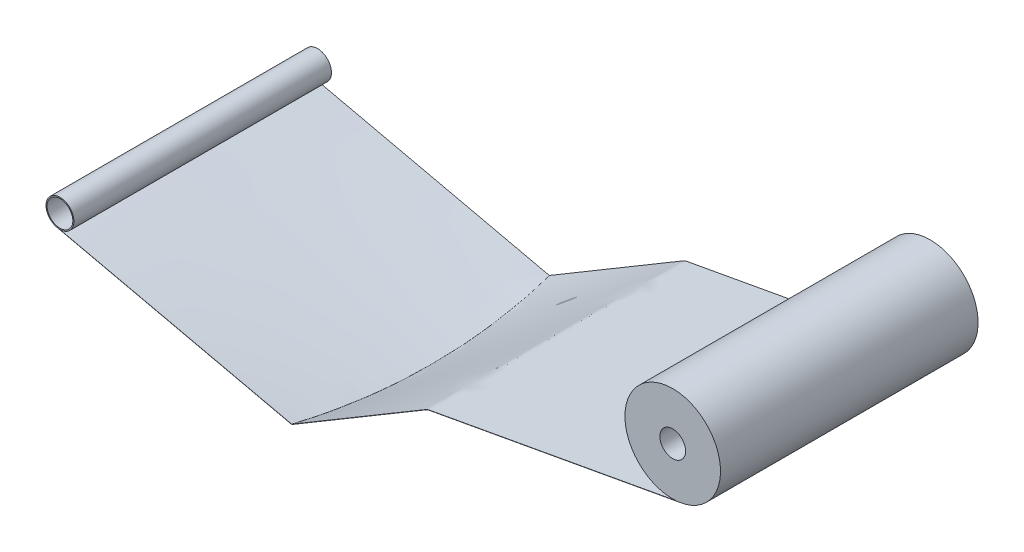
ISO-10303-21;
HEADER;
FILE_DESCRIPTION(('STEP AP214'),'2;1');
FILE_NAME('part.step','',(''),(''),'','','');
FILE_SCHEMA(('AUTOMOTIVE_DESIGN { 1 0 10303 214 1 1 1 1 }'));
ENDSEC;
DATA;
#1=APPLICATION_CONTEXT('core data for automotive mechanical design processes');
#2=APPLICATION_PROTOCOL_DEFINITION('international standard','automotive_design',2000,#1);
#3=PRODUCT_CONTEXT('',#1,'mechanical');
#4=PRODUCT('Part','Part','',(#3));
#5=PRODUCT_RELATED_PRODUCT_CATEGORY('part','',(#4));
#6=PRODUCT_DEFINITION_FORMATION('','',#4);
#7=PRODUCT_DEFINITION_CONTEXT('part definition',#1,'design');
#8=PRODUCT_DEFINITION('design','',#6,#7);
#9=PRODUCT_DEFINITION_SHAPE('','',#8);
#10=(LENGTH_UNIT() NAMED_UNIT(*) SI_UNIT(.MILLI.,.METRE.));
#11=(NAMED_UNIT(*) PLANE_ANGLE_UNIT() SI_UNIT($,.RADIAN.));
#12=(NAMED_UNIT(*) SI_UNIT($,.STERADIAN.) SOLID_ANGLE_UNIT());
#13=UNCERTAINTY_MEASURE_WITH_UNIT(LENGTH_MEASURE(1.E-05),#10,'distance_accuracy_value','');
#14=(GEOMETRIC_REPRESENTATION_CONTEXT(3) GLOBAL_UNCERTAINTY_ASSIGNED_CONTEXT((#13)) GLOBAL_UNIT_ASSIGNED_CONTEXT((#10,
#11,#12)) REPRESENTATION_CONTEXT('',''));
#15=CARTESIAN_POINT('',(0.,0.,0.));
#16=DIRECTION('',(0.,0.,1.));
#17=DIRECTION('',(1.,0.,0.));
#18=AXIS2_PLACEMENT_3D('',#15,#16,#17);
#19=CARTESIAN_POINT('',(471.375872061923,717.346073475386,500.));
#20=CARTESIAN_POINT('',(389.787912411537,702.50552082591,499.999999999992));
#21=CARTESIAN_POINT('',(226.611923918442,672.824402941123,499.99999999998));
#22=CARTESIAN_POINT('',(-18.1031736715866,628.311618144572,499.999999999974));
#23=CARTESIAN_POINT('',(-262.720391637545,583.816637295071,499.999999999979));
#24=CARTESIAN_POINT('',(-425.700765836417,554.1711009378,499.999999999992));
#25=CARTESIAN_POINT('',(-508.415565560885,539.125580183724,500.));
#26=CARTESIAN_POINT('',(-510.754314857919,538.579089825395,500.));
#27=CARTESIAN_POINT('',(-514.021967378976,537.513960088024,500.000000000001));
#28=CARTESIAN_POINT('',(-517.194117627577,536.171757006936,500.000000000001));
#29=CARTESIAN_POINT('',(-519.332371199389,535.041840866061,500.000000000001));
#30=CARTESIAN_POINT('',(-563.630229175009,508.701691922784,500.000000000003));
#31=CARTESIAN_POINT('',(-650.096425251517,457.28763744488,500.000000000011));
#32=CARTESIAN_POINT('',(-779.96556637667,380.065562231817,500.00000000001));
#33=CARTESIAN_POINT('',(-909.894921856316,302.807682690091,500.000000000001));
#34=CARTESIAN_POINT('',(-996.481191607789,251.322230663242,500.));
#35=CARTESIAN_POINT('',(-1039.92087273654,225.492366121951,500.));
#36=CARTESIAN_POINT('',(-1040.27229980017,225.32956028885,500.));
#37=CARTESIAN_POINT('',(-1040.81895411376,225.192191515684,499.999999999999));
#38=CARTESIAN_POINT('',(-1041.37802379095,225.158003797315,500.));
#39=CARTESIAN_POINT('',(-1041.7547802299,225.205115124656,500.));
#40=CARTESIAN_POINT('',(-1117.80840841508,242.483019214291,499.999999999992));
#41=CARTESIAN_POINT('',(-1269.53737099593,276.952886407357,499.999999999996));
#42=CARTESIAN_POINT('',(-1497.13822294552,328.659370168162,500.000000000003));
#43=CARTESIAN_POINT('',(-1724.74401686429,380.366976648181,500.000000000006));
#44=CARTESIAN_POINT('',(-1876.48286003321,414.839088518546,500.00000000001));
#45=CARTESIAN_POINT('',(-1952.3522815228,432.07514443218,500.000000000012));
#46=CARTESIAN_POINT('',(471.375872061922,717.346073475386,458.333333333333));
#47=CARTESIAN_POINT('',(389.809715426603,702.509472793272,458.321901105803));
#48=CARTESIAN_POINT('',(226.677282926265,672.836300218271,458.306005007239));
#49=CARTESIAN_POINT('',(-17.9970110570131,628.331024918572,458.300248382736));
#50=CARTESIAN_POINT('',(-262.622385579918,583.834603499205,458.309761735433));
#51=CARTESIAN_POINT('',(-425.657214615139,554.17909585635,458.324405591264));
#52=CARTESIAN_POINT('',(-508.416237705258,539.125456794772,458.333471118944));
#53=CARTESIAN_POINT('',(-510.813523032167,538.568267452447,458.333747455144));
#54=CARTESIAN_POINT('',(-514.280648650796,537.419884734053,458.334209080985));
#55=CARTESIAN_POINT('',(-517.622481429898,535.95465343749,458.334762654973));
#56=CARTESIAN_POINT('',(-519.781953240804,534.769924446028,458.335222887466));
#57=CARTESIAN_POINT('',(-563.49615869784,508.024885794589,458.345603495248));
#58=CARTESIAN_POINT('',(-648.784421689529,455.853771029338,458.457287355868));
#59=CARTESIAN_POINT('',(-776.8103568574,377.554013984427,458.733828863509));
#60=CARTESIAN_POINT('',(-904.863266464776,299.237318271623,458.954071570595));
#61=CARTESIAN_POINT('',(-990.204926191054,247.032682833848,458.953157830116));
#62=CARTESIAN_POINT('',(-1033.02860272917,220.831922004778,458.887953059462));
#63=CARTESIAN_POINT('',(-1033.38050168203,220.662243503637,458.887431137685));
#64=CARTESIAN_POINT('',(-1033.94150758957,220.514206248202,458.886643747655));
#65=CARTESIAN_POINT('',(-1034.51997643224,220.476639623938,458.885853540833));
#66=CARTESIAN_POINT('',(-1034.90495470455,220.526132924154,458.885325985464));
#67=CARTESIAN_POINT('',(-1111.5393415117,238.19901398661,458.780219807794));
#68=CARTESIAN_POINT('',(-1264.42877785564,273.45623790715,458.600273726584));
#69=CARTESIAN_POINT('',(-1493.77714959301,326.342198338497,458.4189025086));
#70=CARTESIAN_POINT('',(-1723.138467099,379.228010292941,458.325410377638));
#71=CARTESIAN_POINT('',(-1876.0537916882,414.484936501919,458.321222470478));
#72=CARTESIAN_POINT('',(-1952.51318608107,432.11328345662,458.33355209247));
#73=CARTESIAN_POINT('',(471.375872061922,717.346073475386,375.));
#74=CARTESIAN_POINT('',(389.847900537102,702.516408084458,374.974277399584));
#75=CARTESIAN_POINT('',(226.79181239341,672.857139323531,374.938514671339));
#76=CARTESIAN_POINT('',(-17.8108805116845,628.364953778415,374.925570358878));
#77=CARTESIAN_POINT('',(-262.450493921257,583.865974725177,374.946978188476));
#78=CARTESIAN_POINT('',(-425.580816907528,554.193047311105,374.979919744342));
#79=CARTESIAN_POINT('',(-508.417416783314,539.125241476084,375.000309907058));
#80=CARTESIAN_POINT('',(-510.917145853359,538.549330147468,375.000931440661));
#81=CARTESIAN_POINT('',(-514.733355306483,537.255255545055,375.001969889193));
#82=CARTESIAN_POINT('',(-518.37213306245,535.574723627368,375.00321547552));
#83=CARTESIAN_POINT('',(-520.56873175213,534.29406922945,375.004251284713));
#84=CARTESIAN_POINT('',(-563.261372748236,506.840387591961,375.027616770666));
#85=CARTESIAN_POINT('',(-646.482452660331,453.342140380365,375.279182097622));
#86=CARTESIAN_POINT('',(-771.268017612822,373.150083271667,375.902103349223));
#87=CARTESIAN_POINT('',(-896.026659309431,292.974547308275,376.398151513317));
#88=CARTESIAN_POINT('',(-979.192995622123,239.5099537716,376.395970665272));
#89=CARTESIAN_POINT('',(-1020.94421423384,212.660635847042,376.249000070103));
#90=CARTESIAN_POINT('',(-1021.29698337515,212.478934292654,376.247823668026));
#91=CARTESIAN_POINT('',(-1021.88317142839,212.312233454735,376.246048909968));
#92=CARTESIAN_POINT('',(-1022.49565583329,212.268760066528,376.244267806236));
#93=CARTESIAN_POINT('',(-1022.89506702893,212.322426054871,376.243078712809));
#94=CARTESIAN_POINT('',(-1100.55468883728,230.687361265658,376.006172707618));
#95=CARTESIAN_POINT('',(-1255.48920599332,267.324363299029,375.600625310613));
#96=CARTESIAN_POINT('',(-1487.90660583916,322.277932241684,375.192025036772));
#97=CARTESIAN_POINT('',(-1720.34049510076,377.22980771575,374.981638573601));
#98=CARTESIAN_POINT('',(-1875.30798789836,413.863422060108,374.972518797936));
#99=CARTESIAN_POINT('',(-1952.79476926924,432.18002679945,375.000492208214));
#100=CARTESIAN_POINT('',(471.375872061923,717.346073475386,250.));
#101=CARTESIAN_POINT('',(389.888853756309,702.523865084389,249.972133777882));
#102=CARTESIAN_POINT('',(226.914728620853,672.8794924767,249.933393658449));
#103=CARTESIAN_POINT('',(-17.6109830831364,628.40126077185,249.919377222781));
#104=CARTESIAN_POINT('',(-262.265804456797,583.899491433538,249.942571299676));
#105=CARTESIAN_POINT('',(-425.498712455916,554.207941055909,249.978252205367));
#106=CARTESIAN_POINT('',(-508.418683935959,539.125011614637,250.000335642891));
#107=CARTESIAN_POINT('',(-511.028181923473,538.529042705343,250.001008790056));
#108=CARTESIAN_POINT('',(-515.218417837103,537.078870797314,250.002133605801));
#109=CARTESIAN_POINT('',(-519.175351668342,535.16765794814,250.003483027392));
#110=CARTESIAN_POINT('',(-521.41172227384,533.784222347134,250.004605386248));
#111=CARTESIAN_POINT('',(-563.009594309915,505.571162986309,250.029925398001));
#112=CARTESIAN_POINT('',(-644.007917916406,450.647878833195,250.302679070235));
#113=CARTESIAN_POINT('',(-765.301512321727,368.419678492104,250.978080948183));
#114=CARTESIAN_POINT('',(-886.516270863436,286.244460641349,251.515873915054));
#115=CARTESIAN_POINT('',(-967.355656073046,231.428025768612,251.513409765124));
#116=CARTESIAN_POINT('',(-1007.9653930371,203.884529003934,251.35398057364));
#117=CARTESIAN_POINT('',(-1008.31915514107,203.689951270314,251.352704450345));
#118=CARTESIAN_POINT('',(-1008.93241537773,203.503262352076,251.350779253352));
#119=CARTESIAN_POINT('',(-1009.58143656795,203.453468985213,251.348847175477));
#120=CARTESIAN_POINT('',(-1009.99637268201,203.511611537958,251.347557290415));
#121=CARTESIAN_POINT('',(-1088.76662636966,222.619195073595,251.090570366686));
#122=CARTESIAN_POINT('',(-1245.91176512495,260.737142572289,250.650684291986));
#123=CARTESIAN_POINT('',(-1481.63224675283,317.910821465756,250.207615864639));
#124=CARTESIAN_POINT('',(-1717.35871951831,375.082064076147,249.979673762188));
#125=CARTESIAN_POINT('',(-1874.51583746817,413.195138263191,249.970040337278));
#126=CARTESIAN_POINT('',(-1953.09646582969,432.251537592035,250.0005332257));
#127=CARTESIAN_POINT('',(471.375872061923,717.346073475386,125.));
#128=CARTESIAN_POINT('',(389.913443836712,702.528351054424,124.982851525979));
#129=CARTESIAN_POINT('',(226.988570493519,672.892915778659,124.959012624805));
#130=CARTESIAN_POINT('',(-17.4908336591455,628.423024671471,124.950389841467));
#131=CARTESIAN_POINT('',(-262.154758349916,583.919558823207,124.964664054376));
#132=CARTESIAN_POINT('',(-425.449338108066,554.216853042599,124.986619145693));
#133=CARTESIAN_POINT('',(-508.419445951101,539.124874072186,125.00020651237));
#134=CARTESIAN_POINT('',(-511.09480876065,538.516871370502,125.000620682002));
#135=CARTESIAN_POINT('',(-515.509464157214,536.973041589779,125.001312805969));
#136=CARTESIAN_POINT('',(-519.657291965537,534.923419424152,125.002143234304));
#137=CARTESIAN_POINT('',(-521.917522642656,533.478313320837,125.002834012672));
#138=CARTESIAN_POINT('',(-562.858427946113,504.809574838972,125.018418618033));
#139=CARTESIAN_POINT('',(-642.519557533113,449.029878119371,125.186359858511));
#140=CARTESIAN_POINT('',(-761.708961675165,365.576110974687,125.602227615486));
#141=CARTESIAN_POINT('',(-880.790991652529,282.197476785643,125.933345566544));
#142=CARTESIAN_POINT('',(-960.2358844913,226.569094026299,125.931787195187));
#143=CARTESIAN_POINT('',(-1000.16412228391,198.60940492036,125.833589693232));
#144=CARTESIAN_POINT('',(-1000.51850727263,198.407104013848,125.832803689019));
#145=CARTESIAN_POINT('',(-1001.14805165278,198.208426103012,125.831617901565));
#146=CARTESIAN_POINT('',(-1001.81903584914,198.154844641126,125.830427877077));
#147=CARTESIAN_POINT('',(-1002.24331422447,198.215675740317,125.829633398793));
#148=CARTESIAN_POINT('',(-1081.68538735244,217.769368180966,125.67134758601));
#149=CARTESIAN_POINT('',(-1240.16560273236,256.77705144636,125.400424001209));
#150=CARTESIAN_POINT('',(-1477.87456808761,315.284949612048,125.127593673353));
#151=CARTESIAN_POINT('',(-1715.57683292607,373.790373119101,124.987311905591));
#152=CARTESIAN_POINT('',(-1874.04364425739,412.79310632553,124.981485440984));
#153=CARTESIAN_POINT('',(-1953.27748389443,432.294444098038,125.000328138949));
#154=CARTESIAN_POINT('',(471.375872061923,717.346073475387,0.));
#155=CARTESIAN_POINT('',(389.921642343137,702.529847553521,-7.68839042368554E-12));
#156=CARTESIAN_POINT('',(227.013193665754,672.897391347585,-1.92811607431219E-11));
#157=CARTESIAN_POINT('',(-17.4507627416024,628.43027726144,-2.5223587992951E-11));
#158=CARTESIAN_POINT('',(-262.117719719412,583.926243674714,-1.95617475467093E-11));
#159=CARTESIAN_POINT('',(-425.432868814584,554.219821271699,-7.85121074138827E-12));
#160=CARTESIAN_POINT('',(-508.419700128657,539.124828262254,1.06632097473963E-13));
#161=CARTESIAN_POINT('',(-511.117018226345,538.512814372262,3.4908466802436E-13));
#162=CARTESIAN_POINT('',(-515.60648047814,536.937765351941,7.14937937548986E-13));
#163=CARTESIAN_POINT('',(-519.817939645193,534.842006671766,1.07870031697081E-12));
#164=CARTESIAN_POINT('',(-522.086123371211,533.376343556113,1.31143827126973E-12));
#165=CARTESIAN_POINT('',(-562.808029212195,504.555706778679,5.96478235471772E-12));
#166=CARTESIAN_POINT('',(-642.023072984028,448.490399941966,1.02859811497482E-11));
#167=CARTESIAN_POINT('',(-760.510178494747,364.627721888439,7.96094900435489E-12));
#168=CARTESIAN_POINT('',(-878.880658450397,280.847587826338,2.37583090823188E-12));
#169=CARTESIAN_POINT('',(-957.860888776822,224.94847160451,0.));
#170=CARTESIAN_POINT('',(-997.562299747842,196.850083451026,1.49204189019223E-13));
#171=CARTESIAN_POINT('',(-997.916895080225,196.645208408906,1.47457046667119E-13));
#172=CARTESIAN_POINT('',(-998.551871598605,196.442534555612,1.48934927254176E-13));
#173=CARTESIAN_POINT('',(-999.230180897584,196.387690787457,1.50945955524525E-13));
#174=CARTESIAN_POINT('',(-999.657576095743,196.449418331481,1.51078548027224E-13));
#175=CARTESIAN_POINT('',(-1079.32413400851,216.151866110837,3.47467102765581E-13));
#176=CARTESIAN_POINT('',(-1238.25024674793,255.45624541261,6.75051377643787E-13));
#177=CARTESIAN_POINT('',(-1476.62270438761,314.409099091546,6.63098048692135E-13));
#178=CARTESIAN_POINT('',(-1714.9835904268,373.359505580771,4.61870125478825E-13));
#179=CARTESIAN_POINT('',(-1873.88655697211,412.658989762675,1.0842021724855E-13));
#180=CARTESIAN_POINT('',(-1953.33782326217,432.308746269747,-1.58727198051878E-13));
#181=CARTESIAN_POINT('',(471.375872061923,717.346073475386,-125.));
#182=CARTESIAN_POINT('',(389.913443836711,702.528351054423,-124.982851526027));
#183=CARTESIAN_POINT('',(226.988570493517,672.892915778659,-124.959012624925));
#184=CARTESIAN_POINT('',(-17.4908336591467,628.42302467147,-124.950389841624));
#185=CARTESIAN_POINT('',(-262.154758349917,583.919558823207,-124.964664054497));
#186=CARTESIAN_POINT('',(-425.449338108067,554.216853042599,-124.986619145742));
#187=CARTESIAN_POINT('',(-508.419445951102,539.124874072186,-125.00020651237));
#188=CARTESIAN_POINT('',(-511.09480876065,538.516871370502,-125.000620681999));
#189=CARTESIAN_POINT('',(-515.509464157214,536.973041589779,-125.001312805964));
#190=CARTESIAN_POINT('',(-519.657291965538,534.923419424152,-125.002143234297));
#191=CARTESIAN_POINT('',(-521.917522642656,533.478313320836,-125.002834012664));
#192=CARTESIAN_POINT('',(-562.858427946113,504.809574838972,-125.018418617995));
#193=CARTESIAN_POINT('',(-642.519557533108,449.029878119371,-125.186359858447));
#194=CARTESIAN_POINT('',(-761.708961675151,365.576110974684,-125.602227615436));
#195=CARTESIAN_POINT('',(-880.79099165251,282.197476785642,-125.933345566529));
#196=CARTESIAN_POINT('',(-960.235884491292,226.569094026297,-125.931787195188));
#197=CARTESIAN_POINT('',(-1000.16412228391,198.60940492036,-125.833589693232));
#198=CARTESIAN_POINT('',(-1000.51850727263,198.407104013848,-125.832803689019));
#199=CARTESIAN_POINT('',(-1001.14805165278,198.208426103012,-125.831617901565));
#200=CARTESIAN_POINT('',(-1001.81903584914,198.154844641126,-125.830427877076));
#201=CARTESIAN_POINT('',(-1002.24331422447,198.215675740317,-125.829633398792));
#202=CARTESIAN_POINT('',(-1081.68538735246,217.769368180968,-125.67134758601));
#203=CARTESIAN_POINT('',(-1240.1656027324,256.777051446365,-125.400424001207));
#204=CARTESIAN_POINT('',(-1477.87456808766,315.284949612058,-125.127593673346));
#205=CARTESIAN_POINT('',(-1715.57683292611,373.790373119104,-124.987311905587));
#206=CARTESIAN_POINT('',(-1874.04364425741,412.793106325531,-124.981485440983));
#207=CARTESIAN_POINT('',(-1953.27748389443,432.294444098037,-125.000328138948));
#208=CARTESIAN_POINT('',(471.375872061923,717.346073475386,-250.));
#209=CARTESIAN_POINT('',(389.88885375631,702.523865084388,-249.972133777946));
#210=CARTESIAN_POINT('',(226.914728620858,672.879492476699,-249.933393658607));
#211=CARTESIAN_POINT('',(-17.6109830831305,628.401260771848,-249.919377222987));
#212=CARTESIAN_POINT('',(-262.265804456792,583.899491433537,-249.942571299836));
#213=CARTESIAN_POINT('',(-425.498712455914,554.207941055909,-249.978252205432));
#214=CARTESIAN_POINT('',(-508.418683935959,539.125011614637,-250.00033564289));
#215=CARTESIAN_POINT('',(-511.028181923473,538.529042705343,-250.001008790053));
#216=CARTESIAN_POINT('',(-515.218417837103,537.078870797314,-250.002133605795));
#217=CARTESIAN_POINT('',(-519.175351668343,535.16765794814,-250.003483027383));
#218=CARTESIAN_POINT('',(-521.41172227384,533.784222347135,-250.004605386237));
#219=CARTESIAN_POINT('',(-563.009594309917,505.571162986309,-250.029925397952));
#220=CARTESIAN_POINT('',(-644.007917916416,450.647878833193,-250.302679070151));
#221=CARTESIAN_POINT('',(-765.301512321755,368.419678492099,-250.978080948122));
#222=CARTESIAN_POINT('',(-886.516270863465,286.24446064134,-251.515873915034));
#223=CARTESIAN_POINT('',(-967.35565607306,231.428025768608,-251.513409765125));
#224=CARTESIAN_POINT('',(-1007.9653930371,203.884529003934,-251.353980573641));
#225=CARTESIAN_POINT('',(-1008.31915514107,203.689951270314,-251.352704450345));
#226=CARTESIAN_POINT('',(-1008.93241537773,203.503262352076,-251.350779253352));
#227=CARTESIAN_POINT('',(-1009.58143656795,203.453468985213,-251.348847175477));
#228=CARTESIAN_POINT('',(-1009.99637268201,203.511611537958,-251.347557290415));
#229=CARTESIAN_POINT('',(-1088.76662636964,222.619195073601,-251.090570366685));
#230=CARTESIAN_POINT('',(-1245.91176512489,260.737142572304,-250.650684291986));
#231=CARTESIAN_POINT('',(-1481.63224675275,317.91082146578,-250.207615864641));
#232=CARTESIAN_POINT('',(-1717.35871951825,375.082064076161,-249.97967376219));
#233=CARTESIAN_POINT('',(-1874.51583746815,413.195138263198,-249.970040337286));
#234=CARTESIAN_POINT('',(-1953.09646582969,432.251537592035,-250.000533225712));
#235=CARTESIAN_POINT('',(471.375872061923,717.346073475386,-375.));
#236=CARTESIAN_POINT('',(389.847900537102,702.516408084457,-374.974277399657));
#237=CARTESIAN_POINT('',(226.79181239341,672.857139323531,-374.938514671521));
#238=CARTESIAN_POINT('',(-17.8108805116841,628.364953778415,-374.925570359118));
#239=CARTESIAN_POINT('',(-262.450493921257,583.865974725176,-374.946978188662));
#240=CARTESIAN_POINT('',(-425.580816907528,554.193047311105,-374.979919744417));
#241=CARTESIAN_POINT('',(-508.417416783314,539.125241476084,-375.000309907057));
#242=CARTESIAN_POINT('',(-510.917145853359,538.549330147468,-375.000931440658));
#243=CARTESIAN_POINT('',(-514.733355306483,537.255255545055,-375.001969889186));
#244=CARTESIAN_POINT('',(-518.37213306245,535.574723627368,-375.00321547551));
#245=CARTESIAN_POINT('',(-520.56873175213,534.29406922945,-375.0042512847));
#246=CARTESIAN_POINT('',(-563.261372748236,506.84038759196,-375.02761677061));
#247=CARTESIAN_POINT('',(-646.482452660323,453.342140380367,-375.279182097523));
#248=CARTESIAN_POINT('',(-771.2680176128,373.15008327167,-375.902103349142));
#249=CARTESIAN_POINT('',(-896.026659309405,292.974547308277,-376.398151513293));
#250=CARTESIAN_POINT('',(-979.192995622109,239.509953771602,-376.39597066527));
#251=CARTESIAN_POINT('',(-1020.94421423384,212.660635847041,-376.249000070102));
#252=CARTESIAN_POINT('',(-1021.29698337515,212.478934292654,-376.247823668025));
#253=CARTESIAN_POINT('',(-1021.88317142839,212.312233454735,-376.246048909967));
#254=CARTESIAN_POINT('',(-1022.49565583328,212.268760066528,-376.244267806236));
#255=CARTESIAN_POINT('',(-1022.89506702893,212.322426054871,-376.243078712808));
#256=CARTESIAN_POINT('',(-1100.55468883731,230.687361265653,-376.00617270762));
#257=CARTESIAN_POINT('',(-1255.48920599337,267.324363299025,-375.600625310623));
#258=CARTESIAN_POINT('',(-1487.90660583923,322.277932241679,-375.192025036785));
#259=CARTESIAN_POINT('',(-1720.34049510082,377.229807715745,-374.981638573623));
#260=CARTESIAN_POINT('',(-1875.30798789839,413.863422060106,-374.972518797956));
#261=CARTESIAN_POINT('',(-1952.79476926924,432.18002679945,-375.000492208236));
#262=CARTESIAN_POINT('',(471.375872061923,717.346073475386,-458.333333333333));
#263=CARTESIAN_POINT('',(389.809715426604,702.509472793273,-458.321901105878));
#264=CARTESIAN_POINT('',(226.677282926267,672.836300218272,-458.306005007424));
#265=CARTESIAN_POINT('',(-17.9970110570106,628.331024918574,-458.300248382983));
#266=CARTESIAN_POINT('',(-262.622385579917,583.834603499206,-458.309761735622));
#267=CARTESIAN_POINT('',(-425.657214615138,554.17909585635,-458.324405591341));
#268=CARTESIAN_POINT('',(-508.416237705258,539.125456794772,-458.333471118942));
#269=CARTESIAN_POINT('',(-510.813523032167,538.568267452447,-458.33374745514));
#270=CARTESIAN_POINT('',(-514.280648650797,537.419884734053,-458.334209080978));
#271=CARTESIAN_POINT('',(-517.622481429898,535.95465343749,-458.334762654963));
#272=CARTESIAN_POINT('',(-519.781953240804,534.769924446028,-458.335222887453));
#273=CARTESIAN_POINT('',(-563.49615869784,508.024885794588,-458.34560349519));
#274=CARTESIAN_POINT('',(-648.784421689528,455.853771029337,-458.45728735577));
#275=CARTESIAN_POINT('',(-776.81035685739,377.554013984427,-458.733828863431));
#276=CARTESIAN_POINT('',(-904.86326646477,299.237318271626,-458.954071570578));
#277=CARTESIAN_POINT('',(-990.204926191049,247.032682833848,-458.95315783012));
#278=CARTESIAN_POINT('',(-1033.02860272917,220.831922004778,-458.887953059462));
#279=CARTESIAN_POINT('',(-1033.38050168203,220.662243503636,-458.887431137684));
#280=CARTESIAN_POINT('',(-1033.94150758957,220.514206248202,-458.886643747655));
#281=CARTESIAN_POINT('',(-1034.51997643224,220.476639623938,-458.885853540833));
#282=CARTESIAN_POINT('',(-1034.90495470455,220.526132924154,-458.885325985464));
#283=CARTESIAN_POINT('',(-1111.53934151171,238.199013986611,-458.780219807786));
#284=CARTESIAN_POINT('',(-1264.42877785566,273.456237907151,-458.600273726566));
#285=CARTESIAN_POINT('',(-1493.77714959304,326.342198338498,-458.418902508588));
#286=CARTESIAN_POINT('',(-1723.13846709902,379.228010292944,-458.325410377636));
#287=CARTESIAN_POINT('',(-1876.0537916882,414.484936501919,-458.321222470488));
#288=CARTESIAN_POINT('',(-1952.51318608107,432.11328345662,-458.333552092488));
#289=CARTESIAN_POINT('',(471.375872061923,717.346073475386,-500.));
#290=CARTESIAN_POINT('',(389.787912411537,702.50552082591,-500.000000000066));
#291=CARTESIAN_POINT('',(226.611923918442,672.824402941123,-500.000000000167));
#292=CARTESIAN_POINT('',(-18.1031736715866,628.311618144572,-500.000000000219));
#293=CARTESIAN_POINT('',(-262.720391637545,583.816637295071,-500.000000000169));
#294=CARTESIAN_POINT('',(-425.700765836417,554.1711009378,-500.000000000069));
#295=CARTESIAN_POINT('',(-508.415565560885,539.125580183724,-499.999999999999));
#296=CARTESIAN_POINT('',(-510.754314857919,538.579089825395,-499.999999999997));
#297=CARTESIAN_POINT('',(-514.021967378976,537.513960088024,-499.999999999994));
#298=CARTESIAN_POINT('',(-517.194117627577,536.171757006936,-499.999999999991));
#299=CARTESIAN_POINT('',(-519.332371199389,535.041840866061,-499.999999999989));
#300=CARTESIAN_POINT('',(-563.630229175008,508.701691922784,-499.999999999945));
#301=CARTESIAN_POINT('',(-650.096425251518,457.28763744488,-499.99999999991));
#302=CARTESIAN_POINT('',(-779.965566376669,380.065562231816,-499.999999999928));
#303=CARTESIAN_POINT('',(-909.894921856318,302.807682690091,-499.999999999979));
#304=CARTESIAN_POINT('',(-996.481191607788,251.322230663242,-500.));
#305=CARTESIAN_POINT('',(-1039.92087273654,225.492366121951,-499.999999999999));
#306=CARTESIAN_POINT('',(-1040.27229980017,225.32956028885,-500.));
#307=CARTESIAN_POINT('',(-1040.81895411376,225.192191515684,-499.999999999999));
#308=CARTESIAN_POINT('',(-1041.37802379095,225.158003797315,-500.));
#309=CARTESIAN_POINT('',(-1041.7547802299,225.205115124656,-499.999999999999));
#310=CARTESIAN_POINT('',(-1117.80840841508,242.48301921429,-499.999999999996));
#311=CARTESIAN_POINT('',(-1269.53737099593,276.952886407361,-500.000000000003));
#312=CARTESIAN_POINT('',(-1497.13822294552,328.659370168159,-500.000000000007));
#313=CARTESIAN_POINT('',(-1724.74401686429,380.366976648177,-500.000000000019));
#314=CARTESIAN_POINT('',(-1876.48286003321,414.839088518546,-500.000000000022));
#315=CARTESIAN_POINT('',(-1952.3522815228,432.07514443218,-500.000000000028));
#316=B_SPLINE_SURFACE_WITH_KNOTS('',3,3,((#19,#20,#21,#22,#23,#24,#25,#26,#27,#28,#29,#30,#31,
#32,#33,#34,#35,#36,#37,#38,#39,#40,#41,#42,#43,#44,#45),(#46,#47,#48,#49,#50,#51,#52,#53,#54,
#55,#56,#57,#58,#59,#60,#61,#62,#63,#64,#65,#66,#67,#68,#69,#70,#71,#72),(#73,#74,#75,#76,#77,
#78,#79,#80,#81,#82,#83,#84,#85,#86,#87,#88,#89,#90,#91,#92,#93,#94,#95,#96,#97,#98,#99),(#100,
#101,#102,#103,#104,#105,#106,#107,#108,#109,#110,#111,#112,#113,#114,#115,#116,#117,#118,#119,
#120,#121,#122,#123,#124,#125,#126),(#127,#128,#129,#130,#131,#132,#133,#134,#135,#136,#137,
#138,#139,#140,#141,#142,#143,#144,#145,#146,#147,#148,#149,#150,#151,#152,#153),(#154,#155,
#156,#157,#158,#159,#160,#161,#162,#163,#164,#165,#166,#167,#168,#169,#170,#171,#172,#173,#174,
#175,#176,#177,#178,#179,#180),(#181,#182,#183,#184,#185,#186,#187,#188,#189,#190,#191,#192,
#193,#194,#195,#196,#197,#198,#199,#200,#201,#202,#203,#204,#205,#206,#207),(#208,#209,#210,
#211,#212,#213,#214,#215,#216,#217,#218,#219,#220,#221,#222,#223,#224,#225,#226,#227,#228,#229,
#230,#231,#232,#233,#234),(#235,#236,#237,#238,#239,#240,#241,#242,#243,#244,#245,#246,#247,
#248,#249,#250,#251,#252,#253,#254,#255,#256,#257,#258,#259,#260,#261),(#262,#263,#264,#265,
#266,#267,#268,#269,#270,#271,#272,#273,#274,#275,#276,#277,#278,#279,#280,#281,#282,#283,#284,
#285,#286,#287,#288),(#289,#290,#291,#292,#293,#294,#295,#296,#297,#298,#299,#300,#301,#302,
#303,#304,#305,#306,#307,#308,#309,#310,#311,#312,#313,#314,#315)),.UNSPECIFIED.,.F.,.F.,.F.,(4,
1,1,1,1,1,1,1,4),(4,1,1,1,2,1,1,1,2,1,1,1,2,1,1,1,2,1,1,1,4),(0.,0.125,0.25,0.375,0.5,0.625,
0.75,0.875,1.),(0.,0.0971916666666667,0.194383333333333,0.291575,0.388766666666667,
0.390266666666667,0.391766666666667,0.393266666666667,0.394766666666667,0.453066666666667,
0.511366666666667,0.569666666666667,0.627966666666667,0.6282,0.628433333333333,
0.628666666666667,0.6289,0.721675,0.81445,0.907225,1.),.UNSPECIFIED.);
#317=DIRECTION('',(-0.983856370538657,-0.178959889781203,0.));
#318=VECTOR('',#317,1.);
#319=CARTESIAN_POINT('',(-507.158395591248,539.354254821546,500.));
#320=LINE('',#319,#318);
#321=CARTESIAN_POINT('',(451.528643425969,713.735934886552,499.999999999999));
#322=VERTEX_POINT('',#321);
#323=CARTESIAN_POINT('',(-507.158395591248,539.354254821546,500.));
#324=VERTEX_POINT('',#323);
#325=EDGE_CURVE('E402',#322,#324,#320,.T.);
#326=CARTESIAN_POINT('',(451.528643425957,713.735934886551,499.999999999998));
#327=CARTESIAN_POINT('',(451.528653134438,713.735935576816,484.539561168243));
#328=CARTESIAN_POINT('',(451.528660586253,713.735936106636,469.079122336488));
#329=CARTESIAN_POINT('',(451.528671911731,713.73593691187,438.158244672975));
#330=CARTESIAN_POINT('',(451.528675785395,713.735937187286,422.697805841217));
#331=CARTESIAN_POINT('',(451.528680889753,713.735937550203,391.776928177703));
#332=CARTESIAN_POINT('',(451.528682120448,713.735937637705,376.316489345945));
#333=CARTESIAN_POINT('',(451.528682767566,713.735937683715,345.395611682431));
#334=CARTESIAN_POINT('',(451.52868218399,713.735937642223,329.935172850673));
#335=CARTESIAN_POINT('',(451.528679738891,713.735937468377,299.014295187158));
#336=CARTESIAN_POINT('',(451.528677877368,713.735937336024,283.553856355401));
#337=CARTESIAN_POINT('',(451.528673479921,713.735937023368,252.632978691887));
#338=CARTESIAN_POINT('',(451.528670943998,713.735936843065,237.172539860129));
#339=CARTESIAN_POINT('',(451.528665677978,713.735936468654,206.251662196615));
#340=CARTESIAN_POINT('',(451.528662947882,713.735936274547,190.791223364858));
#341=CARTESIAN_POINT('',(451.528657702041,713.735935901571,159.870345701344));
#342=CARTESIAN_POINT('',(451.528655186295,713.735935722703,144.409906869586));
#343=CARTESIAN_POINT('',(451.528650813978,713.735935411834,113.489029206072));
#344=CARTESIAN_POINT('',(451.528648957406,713.735935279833,98.0285903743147));
#345=CARTESIAN_POINT('',(451.52864600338,713.735935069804,67.1077127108));
#346=CARTESIAN_POINT('',(451.528644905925,713.735934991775,51.6472738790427));
#347=CARTESIAN_POINT('',(451.528643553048,713.735934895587,20.7263962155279));
#348=CARTESIAN_POINT('',(451.528643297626,713.735934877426,5.26595738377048));
#349=CARTESIAN_POINT('',(451.528643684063,713.735934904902,-25.6549202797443));
#350=CARTESIAN_POINT('',(451.528644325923,713.735934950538,-41.1153591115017));
#351=CARTESIAN_POINT('',(451.528646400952,713.735935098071,-72.0362367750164));
#352=CARTESIAN_POINT('',(451.528647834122,713.735935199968,-87.4966756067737));
#353=CARTESIAN_POINT('',(451.528651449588,713.735935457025,-118.417553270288));
#354=CARTESIAN_POINT('',(451.528653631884,713.735935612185,-133.877992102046));
#355=CARTESIAN_POINT('',(451.528658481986,713.735935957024,-164.79886976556));
#356=CARTESIAN_POINT('',(451.528661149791,713.735936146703,-180.259308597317));
#357=CARTESIAN_POINT('',(451.528666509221,713.735936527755,-211.180186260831));
#358=CARTESIAN_POINT('',(451.528669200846,713.735936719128,-226.640625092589));
#359=CARTESIAN_POINT('',(451.528674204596,713.735937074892,-257.561502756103));
#360=CARTESIAN_POINT('',(451.52867651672,713.735937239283,-273.02194158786));
#361=CARTESIAN_POINT('',(451.528680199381,713.735937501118,-303.942819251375));
#362=CARTESIAN_POINT('',(451.528681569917,713.735937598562,-319.403258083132));
#363=CARTESIAN_POINT('',(451.528682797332,713.735937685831,-350.324135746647));
#364=CARTESIAN_POINT('',(451.528682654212,713.735937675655,-365.784574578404));
#365=CARTESIAN_POINT('',(451.528680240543,713.735937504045,-396.705452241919));
#366=CARTESIAN_POINT('',(451.528677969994,713.73593734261,-412.165891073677));
#367=CARTESIAN_POINT('',(451.528668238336,713.735936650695,-451.750886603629));
#368=CARTESIAN_POINT('',(451.528658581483,713.735935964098,-475.875443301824));
#369=CARTESIAN_POINT('',(451.528643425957,713.735934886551,-500.000000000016));
#370=B_SPLINE_CURVE_WITH_KNOTS('',3,(#326,#327,#328,#329,#330,#331,#332,#333,#334,#335,#336,
#337,#338,#339,#340,#341,#342,#343,#344,#345,#346,#347,#348,#349,#350,#351,#352,#353,#354,#355,
#356,#357,#358,#359,#360,#361,#362,#363,#364,#365,#366,#367,#368,#369),.UNSPECIFIED.,.F.,.F.,(4,
2,2,2,2,2,2,2,2,2,2,2,2,2,2,2,2,2,2,2,2,4),(0.,46.3813164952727,92.7626329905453,
139.143949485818,185.52526598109,231.906582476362,278.287898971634,324.669215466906,
371.050531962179,417.431848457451,463.813164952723,510.194481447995,556.575797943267,
602.95711443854,649.338430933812,695.719747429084,742.101063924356,788.482380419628,
834.8636969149,881.245013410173,927.626329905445,1000.00000000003),.UNSPECIFIED.);
#371=CARTESIAN_POINT('',(451.528643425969,713.735934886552,-500.000000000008));
#372=VERTEX_POINT('',#371);
#373=EDGE_CURVE('E1040',#322,#372,#370,.T.);
#374=DIRECTION('',(-0.983856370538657,-0.178959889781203,0.));
#375=VECTOR('',#374,1.);
#376=CARTESIAN_POINT('',(-507.158395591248,539.354254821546,-500.));
#377=LINE('',#376,#375);
#378=CARTESIAN_POINT('',(-507.158395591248,539.354254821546,-500.));
#379=VERTEX_POINT('',#378);
#380=EDGE_CURVE('E388',#372,#379,#377,.T.);
#381=CARTESIAN_POINT('',(-500.,500.,-500.));
#382=DIRECTION('',(0.,0.,1.));
#383=DIRECTION('',(-1.,0.,0.));
#384=AXIS2_PLACEMENT_3D('',#381,#382,#383);
#385=CIRCLE('',#384,40.);
#386=CARTESIAN_POINT('',(-520.443521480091,534.381134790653,-499.999999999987));
#387=VERTEX_POINT('',#386);
#388=EDGE_CURVE('E672',#379,#387,#385,.T.);
#389=DIRECTION('',(-0.85952836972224,-0.511088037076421,0.));
#390=VECTOR('',#389,1.);
#391=CARTESIAN_POINT('',(-1039.74770772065,225.595332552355,-500.));
#392=LINE('',#391,#390);
#393=CARTESIAN_POINT('',(-1039.74770772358,225.595332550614,-499.999999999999));
#394=VERTEX_POINT('',#393);
#395=EDGE_CURVE('E688',#387,#394,#392,.T.);
#396=CARTESIAN_POINT('',(-1041.28097183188,228.173917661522,-500.));
#397=DIRECTION('',(0.,0.,-1.));
#398=DIRECTION('',(1.,0.,0.));
#399=AXIS2_PLACEMENT_3D('',#396,#397,#398);
#400=CIRCLE('',#399,3.0000000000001);
#401=CARTESIAN_POINT('',(-1041.94557869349,225.248460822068,-499.999999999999));
#402=VERTEX_POINT('',#401);
#403=EDGE_CURVE('E978',#394,#402,#400,.T.);
#404=DIRECTION('',(-0.975152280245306,0.22153561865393,0.));
#405=VECTOR('',#404,1.);
#406=CARTESIAN_POINT('',(-1952.35228152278,432.075144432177,-500.));
#407=LINE('',#406,#405);
#408=CARTESIAN_POINT('',(-1941.75927882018,429.668620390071,-500.000000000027));
#409=VERTEX_POINT('',#408);
#410=EDGE_CURVE('E963',#402,#409,#407,.T.);
#411=CARTESIAN_POINT('',(-1941.75927882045,429.668620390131,-500.000000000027));
#412=CARTESIAN_POINT('',(-1941.83195528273,429.670188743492,-481.937560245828));
#413=CARTESIAN_POINT('',(-1941.90077000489,429.671816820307,-463.875104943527));
#414=CARTESIAN_POINT('',(-1942.0306434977,429.675110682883,-427.750166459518));
#415=CARTESIAN_POINT('',(-1942.09170226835,429.676776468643,-409.68768327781));
#416=CARTESIAN_POINT('',(-1942.20603138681,429.680064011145,-373.562692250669));
#417=CARTESIAN_POINT('',(-1942.25930173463,429.681685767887,-355.500184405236));
#418=CARTESIAN_POINT('',(-1942.35802240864,429.684815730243,-319.375147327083));
#419=CARTESIAN_POINT('',(-1942.40347273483,429.686323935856,-301.312618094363));
#420=CARTESIAN_POINT('',(-1942.48651903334,429.689166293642,-265.187541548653));
#421=CARTESIAN_POINT('',(-1942.52411500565,429.690500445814,-247.124994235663));
#422=CARTESIAN_POINT('',(-1942.59141031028,429.692943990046,-210.999884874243));
#423=CARTESIAN_POINT('',(-1942.6211096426,429.694053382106,-192.937322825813));
#424=CARTESIAN_POINT('',(-1942.67257482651,429.69600690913,-156.812187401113));
#425=CARTESIAN_POINT('',(-1942.6943406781,429.696851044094,-138.749614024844));
#426=CARTESIAN_POINT('',(-1942.72989680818,429.698243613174,-102.624459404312));
#427=CARTESIAN_POINT('',(-1942.74368708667,429.69879204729,-84.5618781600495));
#428=CARTESIAN_POINT('',(-1942.76328782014,429.699574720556,-48.4367113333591));
#429=CARTESIAN_POINT('',(-1942.76909827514,429.699808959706,-30.3741257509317));
#430=CARTESIAN_POINT('',(-1942.77272825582,429.699955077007,5.75104621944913));
#431=CARTESIAN_POINT('',(-1942.77054778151,429.699866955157,23.8136326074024));
#432=CARTESIAN_POINT('',(-1942.75820259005,429.699371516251,59.9388026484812));
#433=CARTESIAN_POINT('',(-1942.7480378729,429.698964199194,78.0013863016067));
#434=CARTESIAN_POINT('',(-1942.719728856,429.697844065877,114.126547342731));
#435=CARTESIAN_POINT('',(-1942.70158455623,429.697131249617,132.189124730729));
#436=CARTESIAN_POINT('',(-1942.65733990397,429.695425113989,168.314269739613));
#437=CARTESIAN_POINT('',(-1942.63123955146,429.694431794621,186.376837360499));
#438=CARTESIAN_POINT('',(-1942.57112762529,429.692200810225,222.50195941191));
#439=CARTESIAN_POINT('',(-1942.53711605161,429.690963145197,240.564513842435));
#440=CARTESIAN_POINT('',(-1942.46121696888,429.688289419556,276.689606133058));
#441=CARTESIAN_POINT('',(-1942.41932945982,429.686853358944,294.752143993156));
#442=CARTESIAN_POINT('',(-1942.32772303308,429.683839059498,330.877199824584));
#443=CARTESIAN_POINT('',(-1942.2780041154,429.682260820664,348.939717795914));
#444=CARTESIAN_POINT('',(-1942.17075886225,429.679027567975,385.064730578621));
#445=CARTESIAN_POINT('',(-1942.11323252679,429.677372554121,403.127225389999));
#446=CARTESIAN_POINT('',(-1942.00716741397,429.67451302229,434.324769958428));
#447=CARTESIAN_POINT('',(-1941.96045789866,429.673308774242,447.459825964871));
#448=CARTESIAN_POINT('',(-1941.8629403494,429.670932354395,473.729924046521));
#449=CARTESIAN_POINT('',(-1941.81213231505,429.669760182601,486.864966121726));
#450=CARTESIAN_POINT('',(-1941.75927882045,429.668620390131,500.000000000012));
#451=B_SPLINE_CURVE_WITH_KNOTS('',3,(#411,#412,#413,#414,#415,#416,#417,#418,#419,#420,#421,
#422,#423,#424,#425,#426,#427,#428,#429,#430,#431,#432,#433,#434,#435,#436,#437,#438,#439,#440,
#441,#442,#443,#444,#445,#446,#447,#448,#449,#450),.UNSPECIFIED.,.F.,.F.,(4,2,2,2,2,2,2,2,2,2,2,
2,2,2,2,2,2,2,2,4),(0.,54.1877577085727,108.375515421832,162.563273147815,216.75103088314,
270.938788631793,325.126546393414,379.314304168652,433.502061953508,487.689819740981,
541.877577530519,596.065335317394,650.253093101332,704.440850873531,758.628608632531,
812.816366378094,867.004124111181,921.191881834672,960.597298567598,1000.00271913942),.UNSPECIFIED.);
#452=CARTESIAN_POINT('',(-1941.75927882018,429.668620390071,500.000000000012));
#453=VERTEX_POINT('',#452);
#454=EDGE_CURVE('E527',#409,#453,#451,.T.);
#455=DIRECTION('',(-0.975152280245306,0.22153561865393,0.));
#456=VECTOR('',#455,1.);
#457=CARTESIAN_POINT('',(-1952.35228152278,432.075144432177,500.));
#458=LINE('',#457,#456);
#459=CARTESIAN_POINT('',(-1041.94557869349,225.248460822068,500.));
#460=VERTEX_POINT('',#459);
#461=EDGE_CURVE('E1220',#460,#453,#458,.T.);
#462=CARTESIAN_POINT('',(-1041.28097183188,228.173917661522,500.));
#463=DIRECTION('',(0.,0.,-1.));
#464=DIRECTION('',(1.,0.,0.));
#465=AXIS2_PLACEMENT_3D('',#462,#463,#464);
#466=CIRCLE('',#465,3.0000000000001);
#467=CARTESIAN_POINT('',(-1039.74770772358,225.595332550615,500.));
#468=VERTEX_POINT('',#467);
#469=EDGE_CURVE('E836',#468,#460,#466,.T.);
#470=DIRECTION('',(-0.85952836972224,-0.511088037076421,0.));
#471=VECTOR('',#470,1.);
#472=CARTESIAN_POINT('',(-1039.74770772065,225.595332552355,500.));
#473=LINE('',#472,#471);
#474=CARTESIAN_POINT('',(-520.443521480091,534.381134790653,500.000000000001));
#475=VERTEX_POINT('',#474);
#476=EDGE_CURVE('E821',#475,#468,#473,.T.);
#477=CARTESIAN_POINT('',(-500.,500.,500.));
#478=DIRECTION('',(0.,0.,1.));
#479=DIRECTION('',(-1.,0.,0.));
#480=AXIS2_PLACEMENT_3D('',#477,#478,#479);
#481=CIRCLE('',#480,40.);
#482=EDGE_CURVE('E632',#324,#475,#481,.T.);
#483=ORIENTED_EDGE('',*,*,#325,.F.);
#484=ORIENTED_EDGE('',*,*,#373,.T.);
#485=ORIENTED_EDGE('',*,*,#380,.T.);
#486=ORIENTED_EDGE('',*,*,#388,.T.);
#487=ORIENTED_EDGE('',*,*,#395,.T.);
#488=ORIENTED_EDGE('',*,*,#403,.T.);
#489=ORIENTED_EDGE('',*,*,#410,.T.);
#490=ORIENTED_EDGE('',*,*,#454,.T.);
#491=ORIENTED_EDGE('',*,*,#461,.F.);
#492=ORIENTED_EDGE('',*,*,#469,.F.);
#493=ORIENTED_EDGE('',*,*,#476,.F.);
#494=ORIENTED_EDGE('',*,*,#482,.F.);
#495=EDGE_LOOP('',(#483,#484,#485,#486,#487,#488,#489,#490,#491,#492,#493,#494));
#496=FACE_BOUND('',#495,.T.);
#497=ADVANCED_FACE('F383',(#496),#316,.T.);
#498=CARTESIAN_POINT('',(471.375872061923,717.346073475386,500.));
#499=CARTESIAN_POINT('',(389.787912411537,702.50552082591,499.999999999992));
#500=CARTESIAN_POINT('',(226.611923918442,672.824402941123,499.99999999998));
#501=CARTESIAN_POINT('',(-18.1031736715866,628.311618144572,499.999999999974));
#502=CARTESIAN_POINT('',(-262.720391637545,583.816637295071,499.999999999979));
#503=CARTESIAN_POINT('',(-425.700765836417,554.1711009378,499.999999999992));
#504=CARTESIAN_POINT('',(-508.415565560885,539.125580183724,500.));
#505=CARTESIAN_POINT('',(-510.754314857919,538.579089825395,500.));
#506=CARTESIAN_POINT('',(-514.021967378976,537.513960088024,500.000000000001));
#507=CARTESIAN_POINT('',(-517.194117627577,536.171757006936,500.000000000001));
#508=CARTESIAN_POINT('',(-519.332371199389,535.041840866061,500.000000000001));
#509=CARTESIAN_POINT('',(-563.630229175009,508.701691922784,500.000000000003));
#510=CARTESIAN_POINT('',(-650.096425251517,457.28763744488,500.000000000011));
#511=CARTESIAN_POINT('',(-779.96556637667,380.065562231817,500.00000000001));
#512=CARTESIAN_POINT('',(-909.894921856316,302.807682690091,500.000000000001));
#513=CARTESIAN_POINT('',(-996.481191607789,251.322230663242,500.));
#514=CARTESIAN_POINT('',(-1039.92087273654,225.492366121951,500.));
#515=CARTESIAN_POINT('',(-1040.27229980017,225.32956028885,500.));
#516=CARTESIAN_POINT('',(-1040.81895411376,225.192191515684,499.999999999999));
#517=CARTESIAN_POINT('',(-1041.37802379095,225.158003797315,500.));
#518=CARTESIAN_POINT('',(-1041.7547802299,225.205115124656,500.));
#519=CARTESIAN_POINT('',(-1117.80840841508,242.483019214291,499.999999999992));
#520=CARTESIAN_POINT('',(-1269.53737099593,276.952886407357,499.999999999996));
#521=CARTESIAN_POINT('',(-1497.13822294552,328.659370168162,500.000000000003));
#522=CARTESIAN_POINT('',(-1724.74401686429,380.366976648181,500.000000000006));
#523=CARTESIAN_POINT('',(-1876.48286003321,414.839088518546,500.00000000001));
#524=CARTESIAN_POINT('',(-1952.3522815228,432.07514443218,500.000000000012));
#525=CARTESIAN_POINT('',(471.375872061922,717.346073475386,458.333333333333));
#526=CARTESIAN_POINT('',(389.809715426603,702.509472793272,458.321901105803));
#527=CARTESIAN_POINT('',(226.677282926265,672.836300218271,458.306005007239));
#528=CARTESIAN_POINT('',(-17.9970110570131,628.331024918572,458.300248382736));
#529=CARTESIAN_POINT('',(-262.622385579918,583.834603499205,458.309761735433));
#530=CARTESIAN_POINT('',(-425.657214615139,554.17909585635,458.324405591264));
#531=CARTESIAN_POINT('',(-508.416237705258,539.125456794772,458.333471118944));
#532=CARTESIAN_POINT('',(-510.813523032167,538.568267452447,458.333747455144));
#533=CARTESIAN_POINT('',(-514.280648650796,537.419884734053,458.334209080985));
#534=CARTESIAN_POINT('',(-517.622481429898,535.95465343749,458.334762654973));
#535=CARTESIAN_POINT('',(-519.781953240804,534.769924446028,458.335222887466));
#536=CARTESIAN_POINT('',(-563.49615869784,508.024885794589,458.345603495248));
#537=CARTESIAN_POINT('',(-648.784421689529,455.853771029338,458.457287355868));
#538=CARTESIAN_POINT('',(-776.8103568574,377.554013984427,458.733828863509));
#539=CARTESIAN_POINT('',(-904.863266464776,299.237318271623,458.954071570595));
#540=CARTESIAN_POINT('',(-990.204926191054,247.032682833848,458.953157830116));
#541=CARTESIAN_POINT('',(-1033.02860272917,220.831922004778,458.887953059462));
#542=CARTESIAN_POINT('',(-1033.38050168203,220.662243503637,458.887431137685));
#543=CARTESIAN_POINT('',(-1033.94150758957,220.514206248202,458.886643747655));
#544=CARTESIAN_POINT('',(-1034.51997643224,220.476639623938,458.885853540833));
#545=CARTESIAN_POINT('',(-1034.90495470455,220.526132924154,458.885325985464));
#546=CARTESIAN_POINT('',(-1111.5393415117,238.19901398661,458.780219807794));
#547=CARTESIAN_POINT('',(-1264.42877785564,273.45623790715,458.600273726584));
#548=CARTESIAN_POINT('',(-1493.77714959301,326.342198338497,458.4189025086));
#549=CARTESIAN_POINT('',(-1723.138467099,379.228010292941,458.325410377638));
#550=CARTESIAN_POINT('',(-1876.0537916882,414.484936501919,458.321222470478));
#551=CARTESIAN_POINT('',(-1952.51318608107,432.11328345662,458.33355209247));
#552=CARTESIAN_POINT('',(471.375872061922,717.346073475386,375.));
#553=CARTESIAN_POINT('',(389.847900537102,702.516408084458,374.974277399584));
#554=CARTESIAN_POINT('',(226.79181239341,672.857139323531,374.938514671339));
#555=CARTESIAN_POINT('',(-17.8108805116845,628.364953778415,374.925570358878));
#556=CARTESIAN_POINT('',(-262.450493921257,583.865974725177,374.946978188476));
#557=CARTESIAN_POINT('',(-425.580816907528,554.193047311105,374.979919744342));
#558=CARTESIAN_POINT('',(-508.417416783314,539.125241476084,375.000309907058));
#559=CARTESIAN_POINT('',(-510.917145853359,538.549330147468,375.000931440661));
#560=CARTESIAN_POINT('',(-514.733355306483,537.255255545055,375.001969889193));
#561=CARTESIAN_POINT('',(-518.37213306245,535.574723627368,375.00321547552));
#562=CARTESIAN_POINT('',(-520.56873175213,534.29406922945,375.004251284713));
#563=CARTESIAN_POINT('',(-563.261372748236,506.840387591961,375.027616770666));
#564=CARTESIAN_POINT('',(-646.482452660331,453.342140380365,375.279182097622));
#565=CARTESIAN_POINT('',(-771.268017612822,373.150083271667,375.902103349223));
#566=CARTESIAN_POINT('',(-896.026659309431,292.974547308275,376.398151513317));
#567=CARTESIAN_POINT('',(-979.192995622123,239.5099537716,376.395970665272));
#568=CARTESIAN_POINT('',(-1020.94421423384,212.660635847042,376.249000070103));
#569=CARTESIAN_POINT('',(-1021.29698337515,212.478934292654,376.247823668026));
#570=CARTESIAN_POINT('',(-1021.88317142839,212.312233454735,376.246048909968));
#571=CARTESIAN_POINT('',(-1022.49565583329,212.268760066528,376.244267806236));
#572=CARTESIAN_POINT('',(-1022.89506702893,212.322426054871,376.243078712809));
#573=CARTESIAN_POINT('',(-1100.55468883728,230.687361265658,376.006172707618));
#574=CARTESIAN_POINT('',(-1255.48920599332,267.324363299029,375.600625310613));
#575=CARTESIAN_POINT('',(-1487.90660583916,322.277932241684,375.192025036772));
#576=CARTESIAN_POINT('',(-1720.34049510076,377.22980771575,374.981638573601));
#577=CARTESIAN_POINT('',(-1875.30798789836,413.863422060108,374.972518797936));
#578=CARTESIAN_POINT('',(-1952.79476926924,432.18002679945,375.000492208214));
#579=CARTESIAN_POINT('',(471.375872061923,717.346073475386,250.));
#580=CARTESIAN_POINT('',(389.888853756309,702.523865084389,249.972133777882));
#581=CARTESIAN_POINT('',(226.914728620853,672.8794924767,249.933393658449));
#582=CARTESIAN_POINT('',(-17.6109830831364,628.40126077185,249.919377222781));
#583=CARTESIAN_POINT('',(-262.265804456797,583.899491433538,249.942571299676));
#584=CARTESIAN_POINT('',(-425.498712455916,554.207941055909,249.978252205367));
#585=CARTESIAN_POINT('',(-508.418683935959,539.125011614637,250.000335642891));
#586=CARTESIAN_POINT('',(-511.028181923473,538.529042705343,250.001008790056));
#587=CARTESIAN_POINT('',(-515.218417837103,537.078870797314,250.002133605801));
#588=CARTESIAN_POINT('',(-519.175351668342,535.16765794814,250.003483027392));
#589=CARTESIAN_POINT('',(-521.41172227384,533.784222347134,250.004605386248));
#590=CARTESIAN_POINT('',(-563.009594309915,505.571162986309,250.029925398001));
#591=CARTESIAN_POINT('',(-644.007917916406,450.647878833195,250.302679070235));
#592=CARTESIAN_POINT('',(-765.301512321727,368.419678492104,250.978080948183));
#593=CARTESIAN_POINT('',(-886.516270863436,286.244460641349,251.515873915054));
#594=CARTESIAN_POINT('',(-967.355656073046,231.428025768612,251.513409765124));
#595=CARTESIAN_POINT('',(-1007.9653930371,203.884529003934,251.35398057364));
#596=CARTESIAN_POINT('',(-1008.31915514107,203.689951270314,251.352704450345));
#597=CARTESIAN_POINT('',(-1008.93241537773,203.503262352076,251.350779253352));
#598=CARTESIAN_POINT('',(-1009.58143656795,203.453468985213,251.348847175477));
#599=CARTESIAN_POINT('',(-1009.99637268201,203.511611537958,251.347557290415));
#600=CARTESIAN_POINT('',(-1088.76662636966,222.619195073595,251.090570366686));
#601=CARTESIAN_POINT('',(-1245.91176512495,260.737142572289,250.650684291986));
#602=CARTESIAN_POINT('',(-1481.63224675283,317.910821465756,250.207615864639));
#603=CARTESIAN_POINT('',(-1717.35871951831,375.082064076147,249.979673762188));
#604=CARTESIAN_POINT('',(-1874.51583746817,413.195138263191,249.970040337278));
#605=CARTESIAN_POINT('',(-1953.09646582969,432.251537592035,250.0005332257));
#606=CARTESIAN_POINT('',(471.375872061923,717.346073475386,125.));
#607=CARTESIAN_POINT('',(389.913443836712,702.528351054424,124.982851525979));
#608=CARTESIAN_POINT('',(226.988570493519,672.892915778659,124.959012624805));
#609=CARTESIAN_POINT('',(-17.4908336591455,628.423024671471,124.950389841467));
#610=CARTESIAN_POINT('',(-262.154758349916,583.919558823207,124.964664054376));
#611=CARTESIAN_POINT('',(-425.449338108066,554.216853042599,124.986619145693));
#612=CARTESIAN_POINT('',(-508.419445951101,539.124874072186,125.00020651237));
#613=CARTESIAN_POINT('',(-511.09480876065,538.516871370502,125.000620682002));
#614=CARTESIAN_POINT('',(-515.509464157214,536.973041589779,125.001312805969));
#615=CARTESIAN_POINT('',(-519.657291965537,534.923419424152,125.002143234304));
#616=CARTESIAN_POINT('',(-521.917522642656,533.478313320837,125.002834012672));
#617=CARTESIAN_POINT('',(-562.858427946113,504.809574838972,125.018418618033));
#618=CARTESIAN_POINT('',(-642.519557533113,449.029878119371,125.186359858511));
#619=CARTESIAN_POINT('',(-761.708961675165,365.576110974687,125.602227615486));
#620=CARTESIAN_POINT('',(-880.790991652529,282.197476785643,125.933345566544));
#621=CARTESIAN_POINT('',(-960.2358844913,226.569094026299,125.931787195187));
#622=CARTESIAN_POINT('',(-1000.16412228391,198.60940492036,125.833589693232));
#623=CARTESIAN_POINT('',(-1000.51850727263,198.407104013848,125.832803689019));
#624=CARTESIAN_POINT('',(-1001.14805165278,198.208426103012,125.831617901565));
#625=CARTESIAN_POINT('',(-1001.81903584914,198.154844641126,125.830427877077));
#626=CARTESIAN_POINT('',(-1002.24331422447,198.215675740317,125.829633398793));
#627=CARTESIAN_POINT('',(-1081.68538735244,217.769368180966,125.67134758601));
#628=CARTESIAN_POINT('',(-1240.16560273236,256.77705144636,125.400424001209));
#629=CARTESIAN_POINT('',(-1477.87456808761,315.284949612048,125.127593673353));
#630=CARTESIAN_POINT('',(-1715.57683292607,373.790373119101,124.987311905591));
#631=CARTESIAN_POINT('',(-1874.04364425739,412.79310632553,124.981485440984));
#632=CARTESIAN_POINT('',(-1953.27748389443,432.294444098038,125.000328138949));
#633=CARTESIAN_POINT('',(471.375872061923,717.346073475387,0.));
#634=CARTESIAN_POINT('',(389.921642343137,702.529847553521,-7.68839042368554E-12));
#635=CARTESIAN_POINT('',(227.013193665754,672.897391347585,-1.92811607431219E-11));
#636=CARTESIAN_POINT('',(-17.4507627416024,628.43027726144,-2.5223587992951E-11));
#637=CARTESIAN_POINT('',(-262.117719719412,583.926243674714,-1.95617475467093E-11));
#638=CARTESIAN_POINT('',(-425.432868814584,554.219821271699,-7.85121074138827E-12));
#639=CARTESIAN_POINT('',(-508.419700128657,539.124828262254,1.06632097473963E-13));
#640=CARTESIAN_POINT('',(-511.117018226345,538.512814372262,3.4908466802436E-13));
#641=CARTESIAN_POINT('',(-515.60648047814,536.937765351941,7.14937937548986E-13));
#642=CARTESIAN_POINT('',(-519.817939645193,534.842006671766,1.07870031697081E-12));
#643=CARTESIAN_POINT('',(-522.086123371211,533.376343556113,1.31143827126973E-12));
#644=CARTESIAN_POINT('',(-562.808029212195,504.555706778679,5.96478235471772E-12));
#645=CARTESIAN_POINT('',(-642.023072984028,448.490399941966,1.02859811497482E-11));
#646=CARTESIAN_POINT('',(-760.510178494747,364.627721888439,7.96094900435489E-12));
#647=CARTESIAN_POINT('',(-878.880658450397,280.847587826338,2.37583090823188E-12));
#648=CARTESIAN_POINT('',(-957.860888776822,224.94847160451,0.));
#649=CARTESIAN_POINT('',(-997.562299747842,196.850083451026,1.49204189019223E-13));
#650=CARTESIAN_POINT('',(-997.916895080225,196.645208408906,1.47457046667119E-13));
#651=CARTESIAN_POINT('',(-998.551871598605,196.442534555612,1.48934927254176E-13));
#652=CARTESIAN_POINT('',(-999.230180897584,196.387690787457,1.50945955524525E-13));
#653=CARTESIAN_POINT('',(-999.657576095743,196.449418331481,1.51078548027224E-13));
#654=CARTESIAN_POINT('',(-1079.32413400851,216.151866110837,3.47467102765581E-13));
#655=CARTESIAN_POINT('',(-1238.25024674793,255.45624541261,6.75051377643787E-13));
#656=CARTESIAN_POINT('',(-1476.62270438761,314.409099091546,6.63098048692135E-13));
#657=CARTESIAN_POINT('',(-1714.9835904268,373.359505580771,4.61870125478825E-13));
#658=CARTESIAN_POINT('',(-1873.88655697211,412.658989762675,1.0842021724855E-13));
#659=CARTESIAN_POINT('',(-1953.33782326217,432.308746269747,-1.58727198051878E-13));
#660=CARTESIAN_POINT('',(471.375872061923,717.346073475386,-125.));
#661=CARTESIAN_POINT('',(389.913443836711,702.528351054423,-124.982851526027));
#662=CARTESIAN_POINT('',(226.988570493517,672.892915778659,-124.959012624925));
#663=CARTESIAN_POINT('',(-17.4908336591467,628.42302467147,-124.950389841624));
#664=CARTESIAN_POINT('',(-262.154758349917,583.919558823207,-124.964664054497));
#665=CARTESIAN_POINT('',(-425.449338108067,554.216853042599,-124.986619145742));
#666=CARTESIAN_POINT('',(-508.419445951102,539.124874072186,-125.00020651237));
#667=CARTESIAN_POINT('',(-511.09480876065,538.516871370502,-125.000620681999));
#668=CARTESIAN_POINT('',(-515.509464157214,536.973041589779,-125.001312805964));
#669=CARTESIAN_POINT('',(-519.657291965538,534.923419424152,-125.002143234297));
#670=CARTESIAN_POINT('',(-521.917522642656,533.478313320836,-125.002834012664));
#671=CARTESIAN_POINT('',(-562.858427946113,504.809574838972,-125.018418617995));
#672=CARTESIAN_POINT('',(-642.519557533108,449.029878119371,-125.186359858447));
#673=CARTESIAN_POINT('',(-761.708961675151,365.576110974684,-125.602227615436));
#674=CARTESIAN_POINT('',(-880.79099165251,282.197476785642,-125.933345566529));
#675=CARTESIAN_POINT('',(-960.235884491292,226.569094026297,-125.931787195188));
#676=CARTESIAN_POINT('',(-1000.16412228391,198.60940492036,-125.833589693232));
#677=CARTESIAN_POINT('',(-1000.51850727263,198.407104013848,-125.832803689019));
#678=CARTESIAN_POINT('',(-1001.14805165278,198.208426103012,-125.831617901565));
#679=CARTESIAN_POINT('',(-1001.81903584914,198.154844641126,-125.830427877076));
#680=CARTESIAN_POINT('',(-1002.24331422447,198.215675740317,-125.829633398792));
#681=CARTESIAN_POINT('',(-1081.68538735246,217.769368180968,-125.67134758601));
#682=CARTESIAN_POINT('',(-1240.1656027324,256.777051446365,-125.400424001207));
#683=CARTESIAN_POINT('',(-1477.87456808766,315.284949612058,-125.127593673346));
#684=CARTESIAN_POINT('',(-1715.57683292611,373.790373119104,-124.987311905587));
#685=CARTESIAN_POINT('',(-1874.04364425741,412.793106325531,-124.981485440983));
#686=CARTESIAN_POINT('',(-1953.27748389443,432.294444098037,-125.000328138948));
#687=CARTESIAN_POINT('',(471.375872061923,717.346073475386,-250.));
#688=CARTESIAN_POINT('',(389.88885375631,702.523865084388,-249.972133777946));
#689=CARTESIAN_POINT('',(226.914728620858,672.879492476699,-249.933393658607));
#690=CARTESIAN_POINT('',(-17.6109830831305,628.401260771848,-249.919377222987));
#691=CARTESIAN_POINT('',(-262.265804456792,583.899491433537,-249.942571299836));
#692=CARTESIAN_POINT('',(-425.498712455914,554.207941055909,-249.978252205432));
#693=CARTESIAN_POINT('',(-508.418683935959,539.125011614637,-250.00033564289));
#694=CARTESIAN_POINT('',(-511.028181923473,538.529042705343,-250.001008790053));
#695=CARTESIAN_POINT('',(-515.218417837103,537.078870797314,-250.002133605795));
#696=CARTESIAN_POINT('',(-519.175351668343,535.16765794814,-250.003483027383));
#697=CARTESIAN_POINT('',(-521.41172227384,533.784222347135,-250.004605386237));
#698=CARTESIAN_POINT('',(-563.009594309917,505.571162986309,-250.029925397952));
#699=CARTESIAN_POINT('',(-644.007917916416,450.647878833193,-250.302679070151));
#700=CARTESIAN_POINT('',(-765.301512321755,368.419678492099,-250.978080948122));
#701=CARTESIAN_POINT('',(-886.516270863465,286.24446064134,-251.515873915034));
#702=CARTESIAN_POINT('',(-967.35565607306,231.428025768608,-251.513409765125));
#703=CARTESIAN_POINT('',(-1007.9653930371,203.884529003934,-251.353980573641));
#704=CARTESIAN_POINT('',(-1008.31915514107,203.689951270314,-251.352704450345));
#705=CARTESIAN_POINT('',(-1008.93241537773,203.503262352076,-251.350779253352));
#706=CARTESIAN_POINT('',(-1009.58143656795,203.453468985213,-251.348847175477));
#707=CARTESIAN_POINT('',(-1009.99637268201,203.511611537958,-251.347557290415));
#708=CARTESIAN_POINT('',(-1088.76662636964,222.619195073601,-251.090570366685));
#709=CARTESIAN_POINT('',(-1245.91176512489,260.737142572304,-250.650684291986));
#710=CARTESIAN_POINT('',(-1481.63224675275,317.91082146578,-250.207615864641));
#711=CARTESIAN_POINT('',(-1717.35871951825,375.082064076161,-249.97967376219));
#712=CARTESIAN_POINT('',(-1874.51583746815,413.195138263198,-249.970040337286));
#713=CARTESIAN_POINT('',(-1953.09646582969,432.251537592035,-250.000533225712));
#714=CARTESIAN_POINT('',(471.375872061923,717.346073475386,-375.));
#715=CARTESIAN_POINT('',(389.847900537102,702.516408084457,-374.974277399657));
#716=CARTESIAN_POINT('',(226.79181239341,672.857139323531,-374.938514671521));
#717=CARTESIAN_POINT('',(-17.8108805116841,628.364953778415,-374.925570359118));
#718=CARTESIAN_POINT('',(-262.450493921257,583.865974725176,-374.946978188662));
#719=CARTESIAN_POINT('',(-425.580816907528,554.193047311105,-374.979919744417));
#720=CARTESIAN_POINT('',(-508.417416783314,539.125241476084,-375.000309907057));
#721=CARTESIAN_POINT('',(-510.917145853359,538.549330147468,-375.000931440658));
#722=CARTESIAN_POINT('',(-514.733355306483,537.255255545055,-375.001969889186));
#723=CARTESIAN_POINT('',(-518.37213306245,535.574723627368,-375.00321547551));
#724=CARTESIAN_POINT('',(-520.56873175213,534.29406922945,-375.0042512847));
#725=CARTESIAN_POINT('',(-563.261372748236,506.84038759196,-375.02761677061));
#726=CARTESIAN_POINT('',(-646.482452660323,453.342140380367,-375.279182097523));
#727=CARTESIAN_POINT('',(-771.2680176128,373.15008327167,-375.902103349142));
#728=CARTESIAN_POINT('',(-896.026659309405,292.974547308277,-376.398151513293));
#729=CARTESIAN_POINT('',(-979.192995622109,239.509953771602,-376.39597066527));
#730=CARTESIAN_POINT('',(-1020.94421423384,212.660635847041,-376.249000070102));
#731=CARTESIAN_POINT('',(-1021.29698337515,212.478934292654,-376.247823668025));
#732=CARTESIAN_POINT('',(-1021.88317142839,212.312233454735,-376.246048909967));
#733=CARTESIAN_POINT('',(-1022.49565583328,212.268760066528,-376.244267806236));
#734=CARTESIAN_POINT('',(-1022.89506702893,212.322426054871,-376.243078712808));
#735=CARTESIAN_POINT('',(-1100.55468883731,230.687361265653,-376.00617270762));
#736=CARTESIAN_POINT('',(-1255.48920599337,267.324363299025,-375.600625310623));
#737=CARTESIAN_POINT('',(-1487.90660583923,322.277932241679,-375.192025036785));
#738=CARTESIAN_POINT('',(-1720.34049510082,377.229807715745,-374.981638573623));
#739=CARTESIAN_POINT('',(-1875.30798789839,413.863422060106,-374.972518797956));
#740=CARTESIAN_POINT('',(-1952.79476926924,432.18002679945,-375.000492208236));
#741=CARTESIAN_POINT('',(471.375872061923,717.346073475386,-458.333333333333));
#742=CARTESIAN_POINT('',(389.809715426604,702.509472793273,-458.321901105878));
#743=CARTESIAN_POINT('',(226.677282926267,672.836300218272,-458.306005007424));
#744=CARTESIAN_POINT('',(-17.9970110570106,628.331024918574,-458.300248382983));
#745=CARTESIAN_POINT('',(-262.622385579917,583.834603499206,-458.309761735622));
#746=CARTESIAN_POINT('',(-425.657214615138,554.17909585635,-458.324405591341));
#747=CARTESIAN_POINT('',(-508.416237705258,539.125456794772,-458.333471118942));
#748=CARTESIAN_POINT('',(-510.813523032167,538.568267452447,-458.33374745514));
#749=CARTESIAN_POINT('',(-514.280648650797,537.419884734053,-458.334209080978));
#750=CARTESIAN_POINT('',(-517.622481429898,535.95465343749,-458.334762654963));
#751=CARTESIAN_POINT('',(-519.781953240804,534.769924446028,-458.335222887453));
#752=CARTESIAN_POINT('',(-563.49615869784,508.024885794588,-458.34560349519));
#753=CARTESIAN_POINT('',(-648.784421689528,455.853771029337,-458.45728735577));
#754=CARTESIAN_POINT('',(-776.81035685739,377.554013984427,-458.733828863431));
#755=CARTESIAN_POINT('',(-904.86326646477,299.237318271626,-458.954071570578));
#756=CARTESIAN_POINT('',(-990.204926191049,247.032682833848,-458.95315783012));
#757=CARTESIAN_POINT('',(-1033.02860272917,220.831922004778,-458.887953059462));
#758=CARTESIAN_POINT('',(-1033.38050168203,220.662243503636,-458.887431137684));
#759=CARTESIAN_POINT('',(-1033.94150758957,220.514206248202,-458.886643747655));
#760=CARTESIAN_POINT('',(-1034.51997643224,220.476639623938,-458.885853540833));
#761=CARTESIAN_POINT('',(-1034.90495470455,220.526132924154,-458.885325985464));
#762=CARTESIAN_POINT('',(-1111.53934151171,238.199013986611,-458.780219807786));
#763=CARTESIAN_POINT('',(-1264.42877785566,273.456237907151,-458.600273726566));
#764=CARTESIAN_POINT('',(-1493.77714959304,326.342198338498,-458.418902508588));
#765=CARTESIAN_POINT('',(-1723.13846709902,379.228010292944,-458.325410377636));
#766=CARTESIAN_POINT('',(-1876.0537916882,414.484936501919,-458.321222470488));
#767=CARTESIAN_POINT('',(-1952.51318608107,432.11328345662,-458.333552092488));
#768=CARTESIAN_POINT('',(471.375872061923,717.346073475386,-500.));
#769=CARTESIAN_POINT('',(389.787912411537,702.50552082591,-500.000000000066));
#770=CARTESIAN_POINT('',(226.611923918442,672.824402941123,-500.000000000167));
#771=CARTESIAN_POINT('',(-18.1031736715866,628.311618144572,-500.000000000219));
#772=CARTESIAN_POINT('',(-262.720391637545,583.816637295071,-500.000000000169));
#773=CARTESIAN_POINT('',(-425.700765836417,554.1711009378,-500.000000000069));
#774=CARTESIAN_POINT('',(-508.415565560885,539.125580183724,-499.999999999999));
#775=CARTESIAN_POINT('',(-510.754314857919,538.579089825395,-499.999999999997));
#776=CARTESIAN_POINT('',(-514.021967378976,537.513960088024,-499.999999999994));
#777=CARTESIAN_POINT('',(-517.194117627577,536.171757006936,-499.999999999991));
#778=CARTESIAN_POINT('',(-519.332371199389,535.041840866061,-499.999999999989));
#779=CARTESIAN_POINT('',(-563.630229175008,508.701691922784,-499.999999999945));
#780=CARTESIAN_POINT('',(-650.096425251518,457.28763744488,-499.99999999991));
#781=CARTESIAN_POINT('',(-779.965566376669,380.065562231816,-499.999999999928));
#782=CARTESIAN_POINT('',(-909.894921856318,302.807682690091,-499.999999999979));
#783=CARTESIAN_POINT('',(-996.481191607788,251.322230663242,-500.));
#784=CARTESIAN_POINT('',(-1039.92087273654,225.492366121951,-499.999999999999));
#785=CARTESIAN_POINT('',(-1040.27229980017,225.32956028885,-500.));
#786=CARTESIAN_POINT('',(-1040.81895411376,225.192191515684,-499.999999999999));
#787=CARTESIAN_POINT('',(-1041.37802379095,225.158003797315,-500.));
#788=CARTESIAN_POINT('',(-1041.7547802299,225.205115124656,-499.999999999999));
#789=CARTESIAN_POINT('',(-1117.80840841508,242.48301921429,-499.999999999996));
#790=CARTESIAN_POINT('',(-1269.53737099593,276.952886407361,-500.000000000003));
#791=CARTESIAN_POINT('',(-1497.13822294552,328.659370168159,-500.000000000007));
#792=CARTESIAN_POINT('',(-1724.74401686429,380.366976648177,-500.000000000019));
#793=CARTESIAN_POINT('',(-1876.48286003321,414.839088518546,-500.000000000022));
#794=CARTESIAN_POINT('',(-1952.3522815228,432.07514443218,-500.000000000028));
#795=B_SPLINE_SURFACE_WITH_KNOTS('',3,3,((#498,#499,#500,#501,#502,#503,#504,#505,#506,#507,
#508,#509,#510,#511,#512,#513,#514,#515,#516,#517,#518,#519,#520,#521,#522,#523,#524),(#525,
#526,#527,#528,#529,#530,#531,#532,#533,#534,#535,#536,#537,#538,#539,#540,#541,#542,#543,#544,
#545,#546,#547,#548,#549,#550,#551),(#552,#553,#554,#555,#556,#557,#558,#559,#560,#561,#562,
#563,#564,#565,#566,#567,#568,#569,#570,#571,#572,#573,#574,#575,#576,#577,#578),(#579,#580,
#581,#582,#583,#584,#585,#586,#587,#588,#589,#590,#591,#592,#593,#594,#595,#596,#597,#598,#599,
#600,#601,#602,#603,#604,#605),(#606,#607,#608,#609,#610,#611,#612,#613,#614,#615,#616,#617,
#618,#619,#620,#621,#622,#623,#624,#625,#626,#627,#628,#629,#630,#631,#632),(#633,#634,#635,
#636,#637,#638,#639,#640,#641,#642,#643,#644,#645,#646,#647,#648,#649,#650,#651,#652,#653,#654,
#655,#656,#657,#658,#659),(#660,#661,#662,#663,#664,#665,#666,#667,#668,#669,#670,#671,#672,
#673,#674,#675,#676,#677,#678,#679,#680,#681,#682,#683,#684,#685,#686),(#687,#688,#689,#690,
#691,#692,#693,#694,#695,#696,#697,#698,#699,#700,#701,#702,#703,#704,#705,#706,#707,#708,#709,
#710,#711,#712,#713),(#714,#715,#716,#717,#718,#719,#720,#721,#722,#723,#724,#725,#726,#727,
#728,#729,#730,#731,#732,#733,#734,#735,#736,#737,#738,#739,#740),(#741,#742,#743,#744,#745,
#746,#747,#748,#749,#750,#751,#752,#753,#754,#755,#756,#757,#758,#759,#760,#761,#762,#763,#764,
#765,#766,#767),(#768,#769,#770,#771,#772,#773,#774,#775,#776,#777,#778,#779,#780,#781,#782,
#783,#784,#785,#786,#787,#788,#789,#790,#791,#792,#793,#794)),.UNSPECIFIED.,.F.,.F.,.F.,(4,1,1,
1,1,1,1,1,4),(4,1,1,1,2,1,1,1,2,1,1,1,2,1,1,1,2,1,1,1,4),(0.,0.125,0.25,0.375,0.5,0.625,0.75,
0.875,1.),(0.,0.0971916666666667,0.194383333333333,0.291575,0.388766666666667,0.390266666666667,
0.391766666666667,0.393266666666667,0.394766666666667,0.453066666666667,0.511366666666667,
0.569666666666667,0.627966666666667,0.6282,0.628433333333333,0.628666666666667,0.6289,0.721675,
0.81445,0.907225,1.),.UNSPECIFIED.);
#796=OFFSET_SURFACE('',#795,-1.,.F.);
#797=CARTESIAN_POINT('',(465.562585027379,715.27224921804,500.000000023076));
#798=CARTESIAN_POINT('',(465.562595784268,715.27225081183,484.539561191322));
#799=CARTESIAN_POINT('',(465.562604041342,715.272252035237,469.079122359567));
#800=CARTESIAN_POINT('',(465.562616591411,715.272253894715,438.158244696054));
#801=CARTESIAN_POINT('',(465.562620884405,715.272254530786,422.697805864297));
#802=CARTESIAN_POINT('',(465.562626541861,715.272255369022,391.776928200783));
#803=CARTESIAN_POINT('',(465.562627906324,715.272255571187,376.316489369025));
#804=CARTESIAN_POINT('',(465.562628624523,715.272255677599,345.39561170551));
#805=CARTESIAN_POINT('',(465.56262797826,715.272255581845,329.935172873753));
#806=CARTESIAN_POINT('',(465.562625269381,715.272255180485,299.014295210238));
#807=CARTESIAN_POINT('',(465.562623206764,715.272254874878,283.553856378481));
#808=CARTESIAN_POINT('',(465.562618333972,715.272254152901,252.632978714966));
#809=CARTESIAN_POINT('',(465.562615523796,715.272253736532,237.172539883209));
#810=CARTESIAN_POINT('',(465.562609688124,715.272252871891,206.251662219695));
#811=CARTESIAN_POINT('',(465.562606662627,715.272252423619,190.791223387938));
#812=CARTESIAN_POINT('',(465.562600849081,715.272251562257,159.870345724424));
#813=CARTESIAN_POINT('',(465.562598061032,715.272251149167,144.409906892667));
#814=CARTESIAN_POINT('',(465.562593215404,715.272250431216,113.489029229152));
#815=CARTESIAN_POINT('',(465.562591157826,715.272250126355,98.0285903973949));
#816=CARTESIAN_POINT('',(465.562587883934,715.27224964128,67.1077127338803));
#817=CARTESIAN_POINT('',(465.562586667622,715.272249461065,51.6472739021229));
#818=CARTESIAN_POINT('',(465.562585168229,715.272249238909,20.7263962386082));
#819=CARTESIAN_POINT('',(465.562584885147,715.272249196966,5.26595740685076));
#820=CARTESIAN_POINT('',(465.562585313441,715.272249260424,-25.654920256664));
#821=CARTESIAN_POINT('',(465.562586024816,715.272249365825,-41.1153590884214));
#822=CARTESIAN_POINT('',(465.562588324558,715.272249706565,-72.0362367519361));
#823=CARTESIAN_POINT('',(465.562589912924,715.272249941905,-87.4966755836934));
#824=CARTESIAN_POINT('',(465.562593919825,715.272250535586,-118.417553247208));
#825=CARTESIAN_POINT('',(465.56259633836,715.272250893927,-133.877992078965));
#826=CARTESIAN_POINT('',(465.562601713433,715.272251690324,-164.798869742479));
#827=CARTESIAN_POINT('',(465.562604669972,715.272252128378,-180.259308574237));
#828=CARTESIAN_POINT('',(465.562610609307,715.272253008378,-211.180186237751));
#829=CARTESIAN_POINT('',(465.562613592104,715.272253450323,-226.640625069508));
#830=CARTESIAN_POINT('',(465.562619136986,715.27225427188,-257.561502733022));
#831=CARTESIAN_POINT('',(465.562621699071,715.272254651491,-273.021941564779));
#832=CARTESIAN_POINT('',(465.562625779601,715.272255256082,-303.942819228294));
#833=CARTESIAN_POINT('',(465.562627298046,715.272255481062,-319.403258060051));
#834=CARTESIAN_POINT('',(465.562628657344,715.272255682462,-350.324135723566));
#835=CARTESIAN_POINT('',(465.562628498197,715.272255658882,-365.784574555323));
#836=CARTESIAN_POINT('',(465.5626258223,715.272255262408,-396.705452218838));
#837=CARTESIAN_POINT('',(465.56262330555,715.272254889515,-412.165891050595));
#838=CARTESIAN_POINT('',(465.562612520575,715.272253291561,-451.750886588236));
#839=CARTESIAN_POINT('',(465.562601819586,715.272251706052,-475.87544329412));
#840=CARTESIAN_POINT('',(465.562585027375,715.272249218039,-500.));
#841=B_SPLINE_CURVE_WITH_KNOTS('',3,(#797,#798,#799,#800,#801,#802,#803,#804,#805,#806,#807,
#808,#809,#810,#811,#812,#813,#814,#815,#816,#817,#818,#819,#820,#821,#822,#823,#824,#825,#826,
#827,#828,#829,#830,#831,#832,#833,#834,#835,#836,#837,#838,#839,#840),.UNSPECIFIED.,.F.,.F.,(4,
2,2,2,2,2,2,2,2,2,2,2,2,2,2,2,2,2,2,2,2,4),(0.,46.3813164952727,92.7626329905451,
139.143949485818,185.52526598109,231.906582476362,278.287898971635,324.669215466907,
371.050531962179,417.431848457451,463.813164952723,510.194481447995,556.575797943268,
602.95711443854,649.338430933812,695.719747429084,742.101063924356,788.482380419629,
834.863696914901,881.245013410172,927.626329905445,1000.0000000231),.UNSPECIFIED.);
#842=CARTESIAN_POINT('',(465.56258502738,715.27224921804,500.000000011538));
#843=VERTEX_POINT('',#842);
#844=CARTESIAN_POINT('',(465.562585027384,715.272249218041,-500.000000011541));
#845=VERTEX_POINT('',#844);
#846=EDGE_CURVE('E411',#843,#845,#841,.T.);
#847=ORIENTED_EDGE('',*,*,#846,.F.);
#848=CARTESIAN_POINT('',(465.562585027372,715.272249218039,500.000000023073));
#849=CARTESIAN_POINT('',(425.018659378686,707.897456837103,500.000000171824));
#850=CARTESIAN_POINT('',(384.474733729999,700.522664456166,500.000000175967));
#851=CARTESIAN_POINT('',(303.388972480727,685.773459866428,499.999999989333));
#852=CARTESIAN_POINT('',(262.847136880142,678.399047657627,499.999999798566));
#853=CARTESIAN_POINT('',(181.767563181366,663.650968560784,499.999999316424));
#854=CARTESIAN_POINT('',(141.229825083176,656.277301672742,499.999999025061));
#855=CARTESIAN_POINT('',(60.1604511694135,641.531077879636,499.999998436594));
#856=CARTESIAN_POINT('',(19.6288153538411,634.158520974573,499.999998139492));
#857=CARTESIAN_POINT('',(-61.4263514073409,619.414881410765,499.999997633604));
#858=CARTESIAN_POINT('',(-101.94988235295,612.043798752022,499.999997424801));
#859=CARTESIAN_POINT('',(-182.986842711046,597.303470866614,499.999997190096));
#860=CARTESIAN_POINT('',(-223.500272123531,589.934225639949,499.999997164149));
#861=CARTESIAN_POINT('',(-304.515034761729,575.197935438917,499.999997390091));
#862=CARTESIAN_POINT('',(-345.016367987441,567.83089046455,499.999997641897));
#863=CARTESIAN_POINT('',(-426.004940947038,553.099364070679,499.999998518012));
#864=CARTESIAN_POINT('',(-466.492180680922,545.734882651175,499.999999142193));
#865=CARTESIAN_POINT('',(-506.979420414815,538.370401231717,500.));
#866=B_SPLINE_CURVE_WITH_KNOTS('',3,(#848,#849,#850,#851,#852,#853,#854,#855,#856,#857,#858,
#859,#860,#861,#862,#863,#864,#865),.UNSPECIFIED.,.F.,.F.,(4,2,2,2,2,2,2,2,4),(0.,
123.627574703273,247.248776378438,370.857483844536,494.447584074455,618.012970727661,
741.547555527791,865.045256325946,988.499982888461),.UNSPECIFIED.);
#867=CARTESIAN_POINT('',(-506.979435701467,538.370398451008,500.));
#868=VERTEX_POINT('',#867);
#869=EDGE_CURVE('E790',#843,#868,#866,.T.);
#870=ORIENTED_EDGE('',*,*,#869,.T.);
#871=CARTESIAN_POINT('',(-506.979420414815,538.370401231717,500.));
#872=CARTESIAN_POINT('',(-507.281503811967,538.315468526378,500.000000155));
#873=CARTESIAN_POINT('',(-507.582945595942,538.257036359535,499.999999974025));
#874=CARTESIAN_POINT('',(-508.176369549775,538.13469884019,499.999999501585));
#875=CARTESIAN_POINT('',(-508.468390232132,538.070980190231,499.999999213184));
#876=CARTESIAN_POINT('',(-509.324930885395,537.873495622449,499.999998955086));
#877=CARTESIAN_POINT('',(-509.887288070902,537.730237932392,499.999999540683));
#878=CARTESIAN_POINT('',(-510.991514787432,537.423107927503,500.00001759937));
#879=CARTESIAN_POINT('',(-511.533549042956,537.259825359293,500.000034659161));
#880=CARTESIAN_POINT('',(-512.603694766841,536.91162132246,500.000074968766));
#881=CARTESIAN_POINT('',(-513.131894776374,536.726972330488,500.000098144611));
#882=CARTESIAN_POINT('',(-514.180486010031,536.334985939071,500.000165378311));
#883=CARTESIAN_POINT('',(-514.700867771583,536.127623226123,500.000209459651));
#884=CARTESIAN_POINT('',(-515.739373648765,535.687398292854,500.000296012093));
#885=CARTESIAN_POINT('',(-516.257362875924,535.454218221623,500.000338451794));
#886=CARTESIAN_POINT('',(-517.297121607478,534.959174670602,500.000412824));
#887=CARTESIAN_POINT('',(-517.818599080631,534.696696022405,500.000444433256));
#888=CARTESIAN_POINT('',(-518.59979044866,534.280686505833,500.000471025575));
#889=CARTESIAN_POINT('',(-518.864158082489,534.13584079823,500.000476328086));
#890=CARTESIAN_POINT('',(-519.397184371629,533.835690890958,500.000482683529));
#891=CARTESIAN_POINT('',(-519.665740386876,533.680204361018,500.000483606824));
#892=CARTESIAN_POINT('',(-519.932446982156,533.52159850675,500.000483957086));
#893=B_SPLINE_CURVE_WITH_KNOTS('',3,(#871,#872,#873,#874,#875,#876,#877,#878,#879,#880,#881,
#882,#883,#884,#885,#886,#887,#888,#889,#890,#891,#892),.UNSPECIFIED.,.F.,.F.,(4,2,2,2,2,2,2,2,
2,2,4),(0.,0.921079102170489,1.81768202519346,3.55800722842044,5.2557764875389,6.93388540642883,
8.61388391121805,10.3175305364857,12.0683200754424,12.9725885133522,13.9034655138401),.UNSPECIFIED.);
#894=CARTESIAN_POINT('',(-519.932433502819,533.521606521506,500.000483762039));
#895=VERTEX_POINT('',#894);
#896=EDGE_CURVE('E1199',#868,#895,#893,.T.);
#897=ORIENTED_EDGE('',*,*,#896,.T.);
#898=CARTESIAN_POINT('',(-519.932446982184,533.521598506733,500.000483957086));
#899=CARTESIAN_POINT('',(-541.536642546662,520.675435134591,500.008046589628));
#900=CARTESIAN_POINT('',(-563.14088157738,507.829344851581,500.015590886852));
#901=CARTESIAN_POINT('',(-606.368125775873,482.126203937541,500.030668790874));
#902=CARTESIAN_POINT('',(-627.991131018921,469.2691534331,500.038202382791));
#903=CARTESIAN_POINT('',(-671.251374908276,443.546787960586,500.053276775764));
#904=CARTESIAN_POINT('',(-692.888613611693,430.681473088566,500.060817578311));
#905=CARTESIAN_POINT('',(-736.172764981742,404.945291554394,500.075905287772));
#906=CARTESIAN_POINT('',(-757.819677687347,392.074424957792,500.083452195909));
#907=CARTESIAN_POINT('',(-801.118605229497,366.329858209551,500.098537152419));
#908=CARTESIAN_POINT('',(-822.770620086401,353.456158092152,500.106075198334));
#909=CARTESIAN_POINT('',(-866.075163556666,327.708648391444,500.121111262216));
#910=CARTESIAN_POINT('',(-887.727692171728,314.834838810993,500.128609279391));
#911=CARTESIAN_POINT('',(-931.028671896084,289.089831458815,500.14352311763));
#912=CARTESIAN_POINT('',(-952.677122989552,276.218633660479,500.15093895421));
#913=CARTESIAN_POINT('',(-995.965422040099,250.481520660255,500.165621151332));
#914=CARTESIAN_POINT('',(-1017.60526996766,237.615605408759,500.172887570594));
#915=CARTESIAN_POINT('',(-1039.24515035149,224.749744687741,500.180047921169));
#916=B_SPLINE_CURVE_WITH_KNOTS('',3,(#898,#899,#900,#901,#902,#903,#904,#905,#906,#907,#908,
#909,#910,#911,#912,#913,#914,#915),.UNSPECIFIED.,.F.,.F.,(4,2,2,2,2,2,2,2,4),(0.,
75.4048216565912,150.874838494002,226.394228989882,301.947076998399,377.517425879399,
453.08926734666,528.646589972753,604.173628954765),.UNSPECIFIED.);
#917=CARTESIAN_POINT('',(-1039.24497358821,224.74985345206,500.180065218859));
#918=VERTEX_POINT('',#917);
#919=EDGE_CURVE('E1207',#895,#918,#916,.T.);
#920=ORIENTED_EDGE('',*,*,#919,.T.);
#921=CARTESIAN_POINT('',(-1039.24515035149,224.749744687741,500.180047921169));
#922=CARTESIAN_POINT('',(-1039.30172471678,224.71582121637,500.178736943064));
#923=CARTESIAN_POINT('',(-1039.35912719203,224.683278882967,500.177334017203));
#924=CARTESIAN_POINT('',(-1039.47471441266,224.62146264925,500.17438160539));
#925=CARTESIAN_POINT('',(-1039.53287963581,224.592152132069,500.172834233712));
#926=CARTESIAN_POINT('',(-1039.64978348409,224.536805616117,500.169617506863));
#927=CARTESIAN_POINT('',(-1039.70850374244,224.510730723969,500.167950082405));
#928=CARTESIAN_POINT('',(-1039.82634992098,224.461785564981,500.164525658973));
#929=CARTESIAN_POINT('',(-1039.88546016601,224.43887742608,500.16277013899));
#930=CARTESIAN_POINT('',(-1040.0041571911,224.396073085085,500.159163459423));
#931=CARTESIAN_POINT('',(-1040.06373490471,224.376151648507,500.157313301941));
#932=CARTESIAN_POINT('',(-1040.18348731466,224.339215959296,500.153491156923));
#933=CARTESIAN_POINT('',(-1040.24365811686,224.322189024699,500.151519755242));
#934=CARTESIAN_POINT('',(-1040.36448951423,224.29104329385,500.147471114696));
#935=CARTESIAN_POINT('',(-1040.42514722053,224.276913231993,500.145394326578));
#936=CARTESIAN_POINT('',(-1040.54684417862,224.251552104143,500.141146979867));
#937=CARTESIAN_POINT('',(-1040.60788139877,224.240311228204,500.138976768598));
#938=CARTESIAN_POINT('',(-1040.73032836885,224.220692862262,500.134536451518));
#939=CARTESIAN_POINT('',(-1040.79173752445,224.212311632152,500.132266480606));
#940=CARTESIAN_POINT('',(-1040.9149275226,224.198414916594,500.12761876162));
#941=CARTESIAN_POINT('',(-1040.97670863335,224.192901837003,500.125240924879));
#942=CARTESIAN_POINT('',(-1041.10054268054,224.184763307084,500.120388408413));
#943=CARTESIAN_POINT('',(-1041.16259587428,224.182141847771,500.117913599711));
#944=CARTESIAN_POINT('',(-1041.2868727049,224.17980075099,500.112886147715));
#945=CARTESIAN_POINT('',(-1041.34909644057,224.180086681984,500.1103333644));
#946=CARTESIAN_POINT('',(-1041.47382784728,224.183569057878,500.1051174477));
#947=CARTESIAN_POINT('',(-1041.53633501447,224.1867827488,500.102453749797));
#948=CARTESIAN_POINT('',(-1041.66173675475,224.196216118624,500.09699607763));
#949=CARTESIAN_POINT('',(-1041.72462908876,224.20246506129,500.094201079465));
#950=CARTESIAN_POINT('',(-1041.85067747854,224.218058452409,500.088513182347));
#951=CARTESIAN_POINT('',(-1041.91382967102,224.227433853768,500.085619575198));
#952=CARTESIAN_POINT('',(-1042.04020804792,224.249322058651,500.079777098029));
#953=CARTESIAN_POINT('',(-1042.10342918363,224.261863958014,500.076827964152));
#954=CARTESIAN_POINT('',(-1042.16630895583,224.275928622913,500.07388689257));
#955=B_SPLINE_CURVE_WITH_KNOTS('',3,(#921,#922,#923,#924,#925,#926,#927,#928,#929,#930,#931,
#932,#933,#934,#935,#936,#937,#938,#939,#940,#941,#942,#943,#944,#945,#946,#947,#948,#949,#950,
#951,#952,#953,#954),.UNSPECIFIED.,.F.,.F.,(4,2,2,2,2,2,2,2,2,2,2,2,2,2,2,2,4),(0.,
0.197918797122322,0.393295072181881,0.586031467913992,0.776214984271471,0.964688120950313,
1.15231291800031,1.33919361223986,1.52543112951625,1.71142412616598,1.89757288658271,
2.08397824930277,2.27074069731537,2.45861043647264,2.64832855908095,2.83998365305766,
3.03346832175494),.UNSPECIFIED.);
#956=CARTESIAN_POINT('',(-1042.16650940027,224.275971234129,500.073848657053));
#957=VERTEX_POINT('',#956);
#958=EDGE_CURVE('E496',#918,#957,#955,.T.);
#959=ORIENTED_EDGE('',*,*,#958,.T.);
#960=CARTESIAN_POINT('',(-1042.16630895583,224.275928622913,500.07388689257));
#961=CARTESIAN_POINT('',(-1079.96454876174,232.862710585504,500.070693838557));
#962=CARTESIAN_POINT('',(-1117.76278468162,241.449509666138,500.06753357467));
#963=CARTESIAN_POINT('',(-1193.35989952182,258.623287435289,500.061258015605));
#964=CARTESIAN_POINT('',(-1231.15877844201,267.210266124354,500.058142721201));
#965=CARTESIAN_POINT('',(-1306.7571435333,284.384392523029,500.051936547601));
#966=CARTESIAN_POINT('',(-1344.55662970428,292.971540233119,500.048845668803));
#967=CARTESIAN_POINT('',(-1420.15610751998,310.145980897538,500.042688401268));
#968=CARTESIAN_POINT('',(-1457.95609916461,318.733273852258,500.039622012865));
#969=CARTESIAN_POINT('',(-1533.5564864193,335.907981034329,500.033508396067));
#970=CARTESIAN_POINT('',(-1571.35688202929,344.495395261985,500.030461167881));
#971=CARTESIAN_POINT('',(-1646.95797550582,361.67032126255,500.024382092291));
#972=CARTESIAN_POINT('',(-1684.75867337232,370.257833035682,500.021350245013));
#973=CARTESIAN_POINT('',(-1760.36026958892,387.432930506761,500.015297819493));
#974=CARTESIAN_POINT('',(-1798.161167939,396.020516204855,500.012277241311));
#975=CARTESIAN_POINT('',(-1873.7630632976,413.195738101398,500.006243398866));
#976=CARTESIAN_POINT('',(-1911.5640603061,421.783374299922,500.003230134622));
#977=CARTESIAN_POINT('',(-1949.36505431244,430.371023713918,500.000218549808));
#978=B_SPLINE_CURVE_WITH_KNOTS('',3,(#960,#961,#962,#963,#964,#965,#966,#967,#968,#969,#970,
#971,#972,#973,#974,#975,#976,#977),.UNSPECIFIED.,.F.,.F.,(4,2,2,2,2,2,2,2,4),(0.,
116.283953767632,232.569907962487,348.857750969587,465.147169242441,581.43784989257,
697.729479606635,814.021744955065,930.31433248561),.UNSPECIFIED.);
#979=CARTESIAN_POINT('',(-1949.36505470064,430.371023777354,500.000109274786));
#980=VERTEX_POINT('',#979);
#981=EDGE_CURVE('E488',#957,#980,#978,.T.);
#982=ORIENTED_EDGE('',*,*,#981,.T.);
#983=CARTESIAN_POINT('',(-1949.36505508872,430.371023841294,-500.));
#984=CARTESIAN_POINT('',(-1949.42923362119,430.381552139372,-481.937531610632));
#985=CARTESIAN_POINT('',(-1949.49162016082,430.391908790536,-463.875056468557));
#986=CARTESIAN_POINT('',(-1949.61182607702,430.412063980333,-427.750090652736));
#987=CARTESIAN_POINT('',(-1949.66964545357,430.421862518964,-409.68759997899));
#988=CARTESIAN_POINT('',(-1949.7797338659,430.44068666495,-373.562601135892));
#989=CARTESIAN_POINT('',(-1949.83200290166,430.449712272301,-355.500092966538));
#990=CARTESIAN_POINT('',(-1949.93020697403,430.46680084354,-319.375058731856));
#991=CARTESIAN_POINT('',(-1949.97614201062,430.474863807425,-301.312532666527));
#992=CARTESIAN_POINT('',(-1950.03184825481,430.484705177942,-277.599191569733));
#993=CARTESIAN_POINT('',(-1950.04477997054,430.486994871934,-271.948384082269));
#994=CARTESIAN_POINT('',(-1950.07126691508,430.49169405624,-260.050543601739));
#995=CARTESIAN_POINT('',(-1950.08474396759,430.494090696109,-253.80351042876));
#996=CARTESIAN_POINT('',(-1950.11167060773,430.498888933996,-240.898840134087));
#997=CARTESIAN_POINT('',(-1950.12506016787,430.501280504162,-234.241202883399));
#998=CARTESIAN_POINT('',(-1950.15118955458,430.505956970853,-220.729044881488));
#999=CARTESIAN_POINT('',(-1950.16389845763,430.508236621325,-213.87452406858));
#1000=CARTESIAN_POINT('',(-1950.18815849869,430.512596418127,-200.187351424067));
#1001=CARTESIAN_POINT('',(-1950.19971320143,430.514677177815,-193.354699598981));
#1002=CARTESIAN_POINT('',(-1950.22134371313,430.51857892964,-179.9025237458));
#1003=CARTESIAN_POINT('',(-1950.23145441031,430.520406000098,-173.282999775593));
#1004=CARTESIAN_POINT('',(-1950.25006899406,430.523774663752,-160.403830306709));
#1005=CARTESIAN_POINT('',(-1950.25863035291,430.525326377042,-154.144184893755));
#1006=CARTESIAN_POINT('',(-1950.27417647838,430.528147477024,-142.082157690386));
#1007=CARTESIAN_POINT('',(-1950.28123072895,430.529429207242,-136.279775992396));
#1008=CARTESIAN_POINT('',(-1950.29389796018,430.531733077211,-125.184486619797));
#1009=CARTESIAN_POINT('',(-1950.29958310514,430.532768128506,-119.891579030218));
#1010=CARTESIAN_POINT('',(-1950.30970693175,430.534612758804,-109.826874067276));
#1011=CARTESIAN_POINT('',(-1950.31421322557,430.53543450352,-105.055076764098));
#1012=CARTESIAN_POINT('',(-1950.32218363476,430.536888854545,-96.0224143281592));
#1013=CARTESIAN_POINT('',(-1950.32570767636,430.537532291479,-91.7615492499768));
#1014=CARTESIAN_POINT('',(-1950.33190666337,430.538664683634,-83.7257837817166));
#1015=CARTESIAN_POINT('',(-1950.33463260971,430.539162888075,-79.9508834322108));
#1016=CARTESIAN_POINT('',(-1950.33940754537,430.540035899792,-72.8516894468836));
#1017=CARTESIAN_POINT('',(-1950.34149850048,430.540418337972,-69.5273958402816));
#1018=CARTESIAN_POINT('',(-1950.34514942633,430.541086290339,-63.2890123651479));
#1019=CARTESIAN_POINT('',(-1950.34674308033,430.541377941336,-60.3749225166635));
#1020=CARTESIAN_POINT('',(-1950.35415079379,430.542733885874,-45.8044728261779));
#1021=CARTESIAN_POINT('',(-1950.35828318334,430.543491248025,-34.1481120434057));
#1022=CARTESIAN_POINT('',(-1950.36293380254,430.544343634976,-10.8353897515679));
#1023=CARTESIAN_POINT('',(-1950.36345203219,430.544438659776,0.820971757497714));
#1024=CARTESIAN_POINT('',(-1950.36087168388,430.543965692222,24.1336943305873));
#1025=CARTESIAN_POINT('',(-1950.35777310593,430.543397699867,35.7900553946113));
#1026=CARTESIAN_POINT('',(-1950.34307723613,430.540706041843,70.7591372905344));
#1027=CARTESIAN_POINT('',(-1950.32607980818,430.537594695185,94.0718559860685));
#1028=CARTESIAN_POINT('',(-1950.27806324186,430.528848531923,140.697278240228));
#1029=CARTESIAN_POINT('',(-1950.24704410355,430.523213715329,164.009981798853));
#1030=CARTESIAN_POINT('',(-1950.19059270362,430.513032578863,198.979019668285));
#1031=CARTESIAN_POINT('',(-1950.17012178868,430.509350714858,210.635362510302));
#1032=CARTESIAN_POINT('',(-1950.10393346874,430.497491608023,245.604382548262));
#1033=CARTESIAN_POINT('',(-1950.05344048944,430.488500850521,268.917050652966));
#1034=CARTESIAN_POINT('',(-1949.96906817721,430.473630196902,303.886030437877));
#1035=CARTESIAN_POINT('',(-1949.93950526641,430.468442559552,315.542353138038));
#1036=CARTESIAN_POINT('',(-1949.87769021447,430.457653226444,338.854991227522));
#1037=CARTESIAN_POINT('',(-1949.84543807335,430.452051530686,350.511306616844));
#1038=CARTESIAN_POINT('',(-1949.74592197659,430.434867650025,385.13651284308));
#1039=CARTESIAN_POINT('',(-1949.67505670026,430.422757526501,408.105393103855));
#1040=CARTESIAN_POINT('',(-1949.54517037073,430.400858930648,447.987227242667));
#1041=CARTESIAN_POINT('',(-1949.48795270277,430.391300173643,464.900187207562));
#1042=CARTESIAN_POINT('',(-1949.40794785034,430.37807489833,487.867696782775));
#1043=CARTESIAN_POINT('',(-1949.38664000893,430.374565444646,493.922251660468));
#1044=CARTESIAN_POINT('',(-1949.36511000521,430.371032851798,499.98453722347));
#1045=CARTESIAN_POINT('',(-1949.36508254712,430.371028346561,499.992268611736));
#1046=CARTESIAN_POINT('',(-1949.36505508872,430.371023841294,500.));
#1047=B_SPLINE_CURVE_WITH_KNOTS('',3,(#983,#984,#985,#986,#987,#988,#989,#990,#991,#992,#993,
#994,#995,#996,#997,#998,#999,#1000,#1001,#1002,#1003,#1004,#1005,#1006,#1007,#1008,#1009,#1010,
#1011,#1012,#1013,#1014,#1015,#1016,#1017,#1018,#1019,#1020,#1021,#1022,#1023,#1024,#1025,#1026,
#1027,#1028,#1029,#1030,#1031,#1032,#1033,#1034,#1035,#1036,#1037,#1038,#1039,#1040,#1041,#1042,
#1043,#1044,#1045,#1046),.UNSPECIFIED.,.F.,.F.,(4,2,2,2,2,2,2,2,2,2,2,2,2,2,2,2,2,2,2,2,2,2,2,2,
2,2,2,2,2,2,2,4),(0.,54.1877567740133,108.375513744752,162.563270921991,216.751028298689,
233.703496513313,252.44464095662,272.417594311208,292.981193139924,313.47917878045,
333.337774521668,352.116728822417,369.523887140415,385.40261932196,399.718017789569,
412.500617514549,423.825321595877,433.798204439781,442.540475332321,477.509559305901,
512.478643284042,547.447727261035,617.385897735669,687.324067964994,722.293151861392,
792.231321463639,827.200405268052,862.169489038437,931.076465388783,981.815643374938,
999.97942353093,1000.00261784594),.UNSPECIFIED.);
#1048=CARTESIAN_POINT('',(-1949.36505470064,430.371023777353,-500.000109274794));
#1049=VERTEX_POINT('',#1048);
#1050=EDGE_CURVE('E13',#1049,#980,#1047,.T.);
#1051=ORIENTED_EDGE('',*,*,#1050,.F.);
#1052=CARTESIAN_POINT('',(-1042.16650940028,224.275971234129,-500.073848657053));
#1053=CARTESIAN_POINT('',(-1345.61825475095,293.212369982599,-500.04841064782));
#1054=CARTESIAN_POINT('',(-1649.09613254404,362.155767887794,-500.024140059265));
#1055=CARTESIAN_POINT('',(-1952.5738171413,431.099992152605,-499.999962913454));
#1056=B_SPLINE_CURVE_WITH_KNOTS('',3,(#1052,#1053,#1054,#1055),.UNSPECIFIED.,.F.,.F.,(4,4),(0.,
1.),.UNSPECIFIED.);
#1057=CARTESIAN_POINT('',(-1042.16650940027,224.275971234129,-500.073848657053));
#1058=VERTEX_POINT('',#1057);
#1059=EDGE_CURVE('E974',#1058,#1049,#1056,.T.);
#1060=ORIENTED_EDGE('',*,*,#1059,.F.);
#1061=CARTESIAN_POINT('',(-1039.24497358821,224.74985345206,-500.180065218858));
#1062=CARTESIAN_POINT('',(-1039.47315867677,224.613037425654,-500.174741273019));
#1063=CARTESIAN_POINT('',(-1039.70817644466,224.502803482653,-500.168131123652));
#1064=CARTESIAN_POINT('',(-1040.18197719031,224.331953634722,-500.153786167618));
#1065=CARTESIAN_POINT('',(-1040.42446946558,224.269695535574,-500.145614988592));
#1066=CARTESIAN_POINT('',(-1040.91382075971,224.191295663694,-500.127895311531));
#1067=CARTESIAN_POINT('',(-1041.16226904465,224.174868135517,-500.118113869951));
#1068=CARTESIAN_POINT('',(-1041.53578213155,224.185300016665,-500.102542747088));
#1069=CARTESIAN_POINT('',(-1041.66129443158,224.19463060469,-500.097056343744));
#1070=CARTESIAN_POINT('',(-1041.85035246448,224.218017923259,-500.088529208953));
#1071=CARTESIAN_POINT('',(-1041.91350199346,224.227375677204,-500.085637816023));
#1072=CARTESIAN_POINT('',(-1042.00832693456,224.243801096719,-500.081249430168));
#1073=CARTESIAN_POINT('',(-1042.03995203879,224.249674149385,-500.079778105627));
#1074=CARTESIAN_POINT('',(-1042.0874034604,224.259084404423,-500.077561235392));
#1075=CARTESIAN_POINT('',(-1042.10322289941,224.262321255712,-500.076820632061));
#1076=CARTESIAN_POINT('',(-1042.13486453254,224.268995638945,-500.075336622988));
#1077=CARTESIAN_POINT('',(-1042.15069886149,224.272379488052,-500.073849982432));
#1078=CARTESIAN_POINT('',(-1042.16650940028,224.275971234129,-500.073848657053));
#1079=B_SPLINE_CURVE_WITH_KNOTS('',3,(#1061,#1062,#1063,#1064,#1065,#1066,#1067,#1068,#1069,
#1070,#1071,#1072,#1073,#1074,#1075,#1076,#1077,#1078),.UNSPECIFIED.,.F.,.F.,(4,2,2,2,2,2,2,2,
4),(0.,0.25,0.5,0.75,0.875,0.9375,0.96875,0.984375,1.),.UNSPECIFIED.);
#1080=CARTESIAN_POINT('',(-1039.24497358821,224.74985345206,-500.180065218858));
#1081=VERTEX_POINT('',#1080);
#1082=EDGE_CURVE('E1259',#1081,#1058,#1079,.T.);
#1083=ORIENTED_EDGE('',*,*,#1082,.F.);
#1084=CARTESIAN_POINT('',(-519.932433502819,533.521606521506,-500.000483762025));
#1085=CARTESIAN_POINT('',(-606.305766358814,482.162786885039,-500.030730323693));
#1086=CARTESIAN_POINT('',(-692.865726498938,430.694580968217,-500.060822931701));
#1087=CARTESIAN_POINT('',(-822.76708825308,353.458157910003,-500.106079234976));
#1088=CARTESIAN_POINT('',(-866.077755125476,327.707014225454,-500.12115370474));
#1089=CARTESIAN_POINT('',(-931.031515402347,289.088140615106,-500.143523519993));
#1090=CARTESIAN_POINT('',(-952.680728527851,276.216489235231,-500.150937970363));
#1091=CARTESIAN_POINT('',(-985.14805210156,256.913002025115,-500.161953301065));
#1092=CARTESIAN_POINT('',(-995.969410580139,250.479171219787,-500.165607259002));
#1093=CARTESIAN_POINT('',(-1012.1993945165,240.829675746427,-500.171055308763));
#1094=CARTESIAN_POINT('',(-1017.6090468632,237.613385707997,-500.172865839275));
#1095=CARTESIAN_POINT('',(-1025.72295820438,232.789294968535,-500.175572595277));
#1096=CARTESIAN_POINT('',(-1028.42750078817,231.181322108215,-500.176473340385));
#1097=CARTESIAN_POINT('',(-1032.48416615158,228.769452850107,-500.177822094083));
#1098=CARTESIAN_POINT('',(-1033.83636318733,227.965511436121,-500.17827128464));
#1099=CARTESIAN_POINT('',(-1035.86462077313,226.759622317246,-500.178944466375));
#1100=CARTESIAN_POINT('',(-1036.54070030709,226.357663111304,-500.179168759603));
#1101=CARTESIAN_POINT('',(-1037.5548100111,225.754730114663,-500.179505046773));
#1102=CARTESIAN_POINT('',(-1037.89284497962,225.553753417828,-500.179617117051));
#1103=CARTESIAN_POINT('',(-1038.39989502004,225.252289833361,-500.179785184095));
#1104=CARTESIAN_POINT('',(-1038.56891129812,225.151802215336,-500.179841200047));
#1105=CARTESIAN_POINT('',(-1038.82243511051,225.00107115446,-500.179925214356));
#1106=CARTESIAN_POINT('',(-1038.90694294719,224.950827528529,-500.179953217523));
#1107=CARTESIAN_POINT('',(-1039.03370455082,224.875462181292,-500.179995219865));
#1108=CARTESIAN_POINT('',(-1039.07595839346,224.850340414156,-500.180009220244));
#1109=CARTESIAN_POINT('',(-1039.16046602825,224.800096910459,-500.180037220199));
#1110=CARTESIAN_POINT('',(-1039.20283084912,224.775121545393,-500.181048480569));
#1111=CARTESIAN_POINT('',(-1039.24497358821,224.74985345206,-500.180065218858));
#1112=B_SPLINE_CURVE_WITH_KNOTS('',3,(#1084,#1085,#1086,#1087,#1088,#1089,#1090,#1091,#1092,
#1093,#1094,#1095,#1096,#1097,#1098,#1099,#1100,#1101,#1102,#1103,#1104,#1105,#1106,#1107,#1108,
#1109,#1110,#1111),.UNSPECIFIED.,.F.,.F.,(4,2,2,2,2,2,2,2,2,2,2,2,2,4),(0.,0.5,0.75,0.875,
0.9375,0.96875,0.984375,0.9921875,0.99609375,0.998046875,0.9990234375,0.99951171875,
0.999755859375,1.),.UNSPECIFIED.);
#1113=CARTESIAN_POINT('',(-519.932433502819,533.521606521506,-500.000483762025));
#1114=VERTEX_POINT('',#1113);
#1115=EDGE_CURVE('E1258',#1114,#1081,#1112,.T.);
#1116=ORIENTED_EDGE('',*,*,#1115,.F.);
#1117=CARTESIAN_POINT('',(-506.979435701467,538.370398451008,-500.));
#1118=CARTESIAN_POINT('',(-508.206047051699,538.147282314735,-500.000000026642));
#1119=CARTESIAN_POINT('',(-509.344415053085,537.881273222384,-499.999989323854));
#1120=CARTESIAN_POINT('',(-511.548055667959,537.2682710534,-500.000028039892));
#1121=CARTESIAN_POINT('',(-512.609205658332,536.922363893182,-500.00006198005));
#1122=CARTESIAN_POINT('',(-514.702585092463,536.139814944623,-500.000201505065));
#1123=CARTESIAN_POINT('',(-515.732730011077,535.703953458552,-500.000293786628));
#1124=CARTESIAN_POINT('',(-517.807564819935,534.716195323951,-500.000456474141));
#1125=CARTESIAN_POINT('',(-518.848225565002,534.166292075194,-500.000104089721));
#1126=CARTESIAN_POINT('',(-519.932433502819,533.521606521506,-500.000483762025));
#1127=B_SPLINE_CURVE_WITH_KNOTS('',3,(#1117,#1118,#1119,#1120,#1121,#1122,#1123,#1124,#1125,
#1126),.UNSPECIFIED.,.F.,.F.,(4,2,2,2,4),(0.,0.25,0.5,0.75,1.),.UNSPECIFIED.);
#1128=CARTESIAN_POINT('',(-506.979435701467,538.370398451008,-500.));
#1129=VERTEX_POINT('',#1128);
#1130=EDGE_CURVE('E1257',#1129,#1114,#1127,.T.);
#1131=ORIENTED_EDGE('',*,*,#1130,.F.);
#1132=CARTESIAN_POINT('',(-506.979420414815,538.370401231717,-500.));
#1133=CARTESIAN_POINT('',(-466.492180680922,545.734882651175,-499.99999914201));
#1134=CARTESIAN_POINT('',(-426.004940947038,553.099364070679,-499.999998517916));
#1135=CARTESIAN_POINT('',(-345.016367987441,567.83089046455,-499.999997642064));
#1136=CARTESIAN_POINT('',(-304.515034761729,575.197935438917,-499.999997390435));
#1137=CARTESIAN_POINT('',(-223.500272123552,589.934225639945,-499.999997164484));
#1138=CARTESIAN_POINT('',(-182.986842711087,597.303470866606,-499.999997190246));
#1139=CARTESIAN_POINT('',(-101.949882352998,612.043798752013,-499.999997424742));
#1140=CARTESIAN_POINT('',(-61.4263514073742,619.414881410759,-499.999997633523));
#1141=CARTESIAN_POINT('',(19.6288153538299,634.15852097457,-499.999998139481));
#1142=CARTESIAN_POINT('',(60.1604511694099,641.531077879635,-499.999998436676));
#1143=CARTESIAN_POINT('',(141.229825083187,656.277301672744,-499.999999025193));
#1144=CARTESIAN_POINT('',(181.767563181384,663.650968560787,-499.999999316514));
#1145=CARTESIAN_POINT('',(262.847136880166,678.399047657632,-499.999999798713));
#1146=CARTESIAN_POINT('',(303.388972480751,685.773459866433,-499.99999998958));
#1147=CARTESIAN_POINT('',(384.474733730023,700.52266445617,-500.000000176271));
#1148=CARTESIAN_POINT('',(425.01865937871,707.897456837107,-500.000000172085));
#1149=CARTESIAN_POINT('',(465.562585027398,715.272249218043,-500.000000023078));
#1150=B_SPLINE_CURVE_WITH_KNOTS('',3,(#1132,#1133,#1134,#1135,#1136,#1137,#1138,#1139,#1140,
#1141,#1142,#1143,#1144,#1145,#1146,#1147,#1148,#1149),.UNSPECIFIED.,.F.,.F.,(4,2,2,2,2,2,2,2,
4),(0.,123.454726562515,246.95242736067,370.487012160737,494.052398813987,617.642499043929,
741.251206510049,864.872408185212,988.499982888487),.UNSPECIFIED.);
#1151=EDGE_CURVE('E644',#845,#1129,#1150,.F.);
#1152=ORIENTED_EDGE('',*,*,#1151,.F.);
#1153=EDGE_LOOP('',(#847,#870,#897,#920,#959,#982,#1051,#1060,#1083,#1116,#1131,#1152));
#1154=FACE_BOUND('',#1153,.T.);
#1155=ADVANCED_FACE('F491',(#1154),#796,.F.);
#1156=CARTESIAN_POINT('',(-1041.94557869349,225.248460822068,-499.999999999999));
#1157=CARTESIAN_POINT('',(-1345.39690673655,294.186696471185,-499.999999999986));
#1158=CARTESIAN_POINT('',(-1648.87459672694,363.130921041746,-500.000000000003));
#1159=CARTESIAN_POINT('',(-1952.3522815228,432.07514443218,-500.000000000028));
#1160=CARTESIAN_POINT('',(-1042.16650940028,224.275971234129,-500.073848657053));
#1161=CARTESIAN_POINT('',(-1345.61825475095,293.212369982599,-500.04841064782));
#1162=CARTESIAN_POINT('',(-1649.09613254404,362.155767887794,-500.024140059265));
#1163=CARTESIAN_POINT('',(-1952.5738171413,431.099992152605,-499.999962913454));
#1164=B_SPLINE_SURFACE_WITH_KNOTS('',1,3,((#1156,#1157,#1158,#1159),(#1160,#1161,#1162,#1163)),
.UNSPECIFIED.,.F.,.F.,.F.,(2,2),(4,4),(0.,1.),(0.,1.),.UNSPECIFIED.);
#1165=CARTESIAN_POINT('',(-1042.16650940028,224.275971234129,-500.073848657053));
#1166=CARTESIAN_POINT('',(-1345.61825475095,293.212369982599,-500.04841064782));
#1167=CARTESIAN_POINT('',(-1649.09613254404,362.155767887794,-500.024140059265));
#1168=CARTESIAN_POINT('',(-1952.5738171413,431.099992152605,-499.999962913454));
#1169=B_SPLINE_CURVE_WITH_KNOTS('',3,(#1165,#1166,#1167,#1168),.UNSPECIFIED.,.F.,.F.,(4,4),(0.,
1.),.UNSPECIFIED.);
#1170=CARTESIAN_POINT('',(-1952.10829830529,430.994235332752,-500.000000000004));
#1171=VERTEX_POINT('',#1170);
#1172=EDGE_CURVE('E987',#1049,#1171,#1169,.T.);
#1173=CARTESIAN_POINT('',(-1951.88676233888,431.969387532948,-500.000000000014));
#1174=CARTESIAN_POINT('',(-1951.93975049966,431.736146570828,-500.000000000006));
#1175=CARTESIAN_POINT('',(-1951.99273848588,431.502905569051,-500.000000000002));
#1176=CARTESIAN_POINT('',(-1952.07396819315,431.145349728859,-499.999999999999));
#1177=CARTESIAN_POINT('',(-1952.10221003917,431.021034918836,-499.999999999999));
#1178=CARTESIAN_POINT('',(-1952.1304518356,430.896720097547,-500.));
#1179=B_SPLINE_CURVE_WITH_KNOTS('',3,(#1173,#1174,#1175,#1176,#1177,#1178),.UNSPECIFIED.,.F.,
.F.,(4,2,4),(0.,0.717552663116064,1.09999999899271),.UNSPECIFIED.);
#1180=CARTESIAN_POINT('',(-1951.88676233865,431.969387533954,-500.000000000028));
#1181=VERTEX_POINT('',#1180);
#1182=EDGE_CURVE('E989',#1171,#1181,#1179,.F.);
#1183=EDGE_CURVE('E529',#409,#1181,#407,.T.);
#1184=CARTESIAN_POINT('',(-1042.16650940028,224.275971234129,-500.073848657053));
#1185=CARTESIAN_POINT('',(-1041.94557869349,225.248460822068,-499.999999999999));
#1186=B_SPLINE_CURVE_WITH_KNOTS('',1,(#1184,#1185),.UNSPECIFIED.,.F.,.F.,(2,2),(0.,1.),.UNSPECIFIED.);
#1187=EDGE_CURVE('E1197',#1058,#402,#1186,.T.);
#1188=ORIENTED_EDGE('',*,*,#1172,.T.);
#1189=ORIENTED_EDGE('',*,*,#1182,.T.);
#1190=ORIENTED_EDGE('',*,*,#1183,.F.);
#1191=ORIENTED_EDGE('',*,*,#410,.F.);
#1192=ORIENTED_EDGE('',*,*,#1187,.F.);
#1193=ORIENTED_EDGE('',*,*,#1059,.T.);
#1194=EDGE_LOOP('',(#1188,#1189,#1190,#1191,#1192,#1193));
#1195=FACE_BOUND('',#1194,.T.);
#1196=ADVANCED_FACE('F571',(#1195),#1164,.T.);
#1197=CARTESIAN_POINT('',(-507.158395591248,539.354254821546,-500.));
#1198=CARTESIAN_POINT('',(-508.415565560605,539.125580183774,-499.999999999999));
#1199=CARTESIAN_POINT('',(-509.584940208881,538.852335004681,-499.999999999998));
#1200=CARTESIAN_POINT('',(-511.843532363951,538.224046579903,-499.999999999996));
#1201=CARTESIAN_POINT('',(-512.932749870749,537.86900333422,-499.999999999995));
#1202=CARTESIAN_POINT('',(-515.079350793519,537.066559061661,-499.999999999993));
#1203=CARTESIAN_POINT('',(-516.136734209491,536.619158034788,-499.999999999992));
#1204=CARTESIAN_POINT('',(-518.263244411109,535.606798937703,-499.999999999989));
#1205=CARTESIAN_POINT('',(-519.332371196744,535.041840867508,-499.999999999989));
#1206=CARTESIAN_POINT('',(-520.443521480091,534.381134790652,-499.999999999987));
#1207=CARTESIAN_POINT('',(-506.979435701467,538.370398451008,-500.));
#1208=CARTESIAN_POINT('',(-508.206047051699,538.147282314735,-500.000000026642));
#1209=CARTESIAN_POINT('',(-509.344415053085,537.881273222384,-499.999989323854));
#1210=CARTESIAN_POINT('',(-511.548055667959,537.2682710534,-500.000028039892));
#1211=CARTESIAN_POINT('',(-512.609205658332,536.922363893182,-500.00006198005));
#1212=CARTESIAN_POINT('',(-514.702585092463,536.139814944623,-500.000201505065));
#1213=CARTESIAN_POINT('',(-515.732730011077,535.703953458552,-500.000293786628));
#1214=CARTESIAN_POINT('',(-517.807564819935,534.716195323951,-500.000456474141));
#1215=CARTESIAN_POINT('',(-518.848225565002,534.166292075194,-500.000104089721));
#1216=CARTESIAN_POINT('',(-519.932433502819,533.521606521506,-500.000483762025));
#1217=B_SPLINE_SURFACE_WITH_KNOTS('',1,3,((#1197,#1198,#1199,#1200,#1201,#1202,#1203,#1204,
#1205,#1206),(#1207,#1208,#1209,#1210,#1211,#1212,#1213,#1214,#1215,#1216)),.UNSPECIFIED.,.F.,
.F.,.F.,(2,2),(4,2,2,2,4),(0.,1.),(0.,0.25,0.5,0.75,1.),.UNSPECIFIED.);
#1218=CARTESIAN_POINT('',(-507.158395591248,539.354254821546,-500.));
#1219=CARTESIAN_POINT('',(-506.979435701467,538.370398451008,-500.));
#1220=B_SPLINE_CURVE_WITH_KNOTS('',1,(#1218,#1219),.UNSPECIFIED.,.F.,.F.,(2,2),(0.,1.),.UNSPECIFIED.);
#1221=EDGE_CURVE('E394',#1129,#379,#1220,.F.);
#1222=CARTESIAN_POINT('',(-519.932433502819,533.521606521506,-500.000483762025));
#1223=CARTESIAN_POINT('',(-520.443521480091,534.381134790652,-499.999999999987));
#1224=B_SPLINE_CURVE_WITH_KNOTS('',1,(#1222,#1223),.UNSPECIFIED.,.F.,.F.,(2,2),(0.,1.),.UNSPECIFIED.);
#1225=EDGE_CURVE('E745',#1114,#387,#1224,.T.);
#1226=ORIENTED_EDGE('',*,*,#1221,.F.);
#1227=ORIENTED_EDGE('',*,*,#1130,.T.);
#1228=ORIENTED_EDGE('',*,*,#1225,.T.);
#1229=ORIENTED_EDGE('',*,*,#388,.F.);
#1230=EDGE_LOOP('',(#1226,#1227,#1228,#1229));
#1231=FACE_BOUND('',#1230,.T.);
#1232=ADVANCED_FACE('F702',(#1231),#1217,.T.);
#1233=CARTESIAN_POINT('',(-520.443521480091,534.381134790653,-499.999999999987));
#1234=CARTESIAN_POINT('',(-606.816846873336,483.022302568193,-499.999999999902));
#1235=CARTESIAN_POINT('',(-693.376103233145,431.552913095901,-499.99999999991));
#1236=CARTESIAN_POINT('',(-823.275351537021,354.312935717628,-499.999999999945));
#1237=CARTESIAN_POINT('',(-866.585136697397,328.560309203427,-499.999999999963));
#1238=CARTESIAN_POINT('',(-931.537326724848,289.938794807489,-499.999999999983));
#1239=CARTESIAN_POINT('',(-953.18597544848,277.066194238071,-499.999999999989));
#1240=CARTESIAN_POINT('',(-985.652396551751,257.761189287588,-499.999999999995));
#1241=CARTESIAN_POINT('',(-996.473444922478,251.326836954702,-499.999999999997));
#1242=CARTESIAN_POINT('',(-1012.70295072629,241.67653737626,-499.999999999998));
#1243=CARTESIAN_POINT('',(-1018.11244153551,238.45997567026,-499.999999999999));
#1244=CARTESIAN_POINT('',(-1026.22610746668,233.635472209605,-499.999999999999));
#1245=CARTESIAN_POINT('',(-1028.93056772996,232.027360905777,-499.999999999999));
#1246=CARTESIAN_POINT('',(-1032.98710885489,229.615282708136,-499.999999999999));
#1247=CARTESIAN_POINT('',(-1034.33926435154,228.811271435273,-499.999999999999));
#1248=CARTESIAN_POINT('',(-1036.36745944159,227.605277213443,-499.999999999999));
#1249=CARTESIAN_POINT('',(-1037.04351811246,227.203282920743,-499.999999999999));
#1250=CARTESIAN_POINT('',(-1038.05759647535,226.600297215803,-499.999999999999));
#1251=CARTESIAN_POINT('',(-1038.39562098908,226.399302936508,-499.999999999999));
#1252=CARTESIAN_POINT('',(-1038.90265533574,226.097812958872,-499.999999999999));
#1253=CARTESIAN_POINT('',(-1039.07166638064,225.997316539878,-499.999999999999));
#1254=CARTESIAN_POINT('',(-1039.32518234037,225.846572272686,-499.999999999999));
#1255=CARTESIAN_POINT('',(-1039.40968755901,225.796324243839,-499.999999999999));
#1256=CARTESIAN_POINT('',(-1039.53644523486,225.720952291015,-499.999999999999));
#1257=CARTESIAN_POINT('',(-1039.57869776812,225.695828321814,-499.999999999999));
#1258=CARTESIAN_POINT('',(-1039.66320278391,225.645580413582,-499.999999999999));
#1259=CARTESIAN_POINT('',(-1039.70545526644,225.620456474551,-499.999999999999));
#1260=CARTESIAN_POINT('',(-1039.74770772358,225.595332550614,-499.999999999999));
#1261=CARTESIAN_POINT('',(-519.932433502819,533.521606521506,-500.000483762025));
#1262=CARTESIAN_POINT('',(-606.305766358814,482.162786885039,-500.030730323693));
#1263=CARTESIAN_POINT('',(-692.865726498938,430.694580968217,-500.060822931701));
#1264=CARTESIAN_POINT('',(-822.76708825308,353.458157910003,-500.106079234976));
#1265=CARTESIAN_POINT('',(-866.077755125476,327.707014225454,-500.12115370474));
#1266=CARTESIAN_POINT('',(-931.031515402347,289.088140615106,-500.143523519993));
#1267=CARTESIAN_POINT('',(-952.680728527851,276.216489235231,-500.150937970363));
#1268=CARTESIAN_POINT('',(-985.14805210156,256.913002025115,-500.161953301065));
#1269=CARTESIAN_POINT('',(-995.969410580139,250.479171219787,-500.165607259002));
#1270=CARTESIAN_POINT('',(-1012.1993945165,240.829675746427,-500.171055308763));
#1271=CARTESIAN_POINT('',(-1017.6090468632,237.613385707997,-500.172865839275));
#1272=CARTESIAN_POINT('',(-1025.72295820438,232.789294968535,-500.175572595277));
#1273=CARTESIAN_POINT('',(-1028.42750078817,231.181322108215,-500.176473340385));
#1274=CARTESIAN_POINT('',(-1032.48416615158,228.769452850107,-500.177822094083));
#1275=CARTESIAN_POINT('',(-1033.83636318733,227.965511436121,-500.17827128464));
#1276=CARTESIAN_POINT('',(-1035.86462077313,226.759622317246,-500.178944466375));
#1277=CARTESIAN_POINT('',(-1036.54070030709,226.357663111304,-500.179168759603));
#1278=CARTESIAN_POINT('',(-1037.5548100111,225.754730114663,-500.179505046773));
#1279=CARTESIAN_POINT('',(-1037.89284497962,225.553753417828,-500.179617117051));
#1280=CARTESIAN_POINT('',(-1038.39989502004,225.252289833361,-500.179785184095));
#1281=CARTESIAN_POINT('',(-1038.56891129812,225.151802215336,-500.179841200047));
#1282=CARTESIAN_POINT('',(-1038.82243511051,225.00107115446,-500.179925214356));
#1283=CARTESIAN_POINT('',(-1038.90694294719,224.950827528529,-500.179953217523));
#1284=CARTESIAN_POINT('',(-1039.03370455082,224.875462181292,-500.179995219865));
#1285=CARTESIAN_POINT('',(-1039.07595839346,224.850340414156,-500.180009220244));
#1286=CARTESIAN_POINT('',(-1039.16046602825,224.800096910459,-500.180037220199));
#1287=CARTESIAN_POINT('',(-1039.20283084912,224.775121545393,-500.181048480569));
#1288=CARTESIAN_POINT('',(-1039.24497358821,224.74985345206,-500.180065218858));
#1289=B_SPLINE_SURFACE_WITH_KNOTS('',1,3,((#1233,#1234,#1235,#1236,#1237,#1238,#1239,#1240,
#1241,#1242,#1243,#1244,#1245,#1246,#1247,#1248,#1249,#1250,#1251,#1252,#1253,#1254,#1255,#1256,
#1257,#1258,#1259,#1260),(#1261,#1262,#1263,#1264,#1265,#1266,#1267,#1268,#1269,#1270,#1271,
#1272,#1273,#1274,#1275,#1276,#1277,#1278,#1279,#1280,#1281,#1282,#1283,#1284,#1285,#1286,#1287,
#1288)),.UNSPECIFIED.,.F.,.F.,.F.,(2,2),(4,2,2,2,2,2,2,2,2,2,2,2,2,4),(0.,1.),(0.,0.5,0.75,
0.875,0.9375,0.96875,0.984375,0.9921875,0.99609375,0.998046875,0.9990234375,0.99951171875,
0.999755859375,1.),.UNSPECIFIED.);
#1290=CARTESIAN_POINT('',(-1039.24497358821,224.74985345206,-500.180065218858));
#1291=CARTESIAN_POINT('',(-1039.74770772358,225.595332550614,-499.999999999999));
#1292=B_SPLINE_CURVE_WITH_KNOTS('',1,(#1290,#1291),.UNSPECIFIED.,.F.,.F.,(2,2),(0.,1.),.UNSPECIFIED.);
#1293=EDGE_CURVE('E1198',#1081,#394,#1292,.T.);
#1294=ORIENTED_EDGE('',*,*,#1225,.F.);
#1295=ORIENTED_EDGE('',*,*,#1115,.T.);
#1296=ORIENTED_EDGE('',*,*,#1293,.T.);
#1297=ORIENTED_EDGE('',*,*,#395,.F.);
#1298=EDGE_LOOP('',(#1294,#1295,#1296,#1297));
#1299=FACE_BOUND('',#1298,.T.);
#1300=ADVANCED_FACE('F712',(#1299),#1289,.T.);
#1301=CARTESIAN_POINT('',(-1039.74770772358,225.595332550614,-499.999999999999));
#1302=CARTESIAN_POINT('',(-1039.92087273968,225.492366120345,-499.999999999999));
#1303=CARTESIAN_POINT('',(-1040.09658627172,225.410963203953,-500.));
#1304=CARTESIAN_POINT('',(-1040.45451790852,225.283770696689,-499.999999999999));
#1305=CARTESIAN_POINT('',(-1040.63673601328,225.237981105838,-499.999999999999));
#1306=CARTESIAN_POINT('',(-1041.00531067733,225.180795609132,-499.999999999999));
#1307=CARTESIAN_POINT('',(-1041.19166723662,225.169399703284,-500.));
#1308=CARTESIAN_POINT('',(-1041.47271832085,225.178519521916,-500.));
#1309=CARTESIAN_POINT('',(-1041.56665472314,225.185928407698,-500.));
#1310=CARTESIAN_POINT('',(-1041.70820265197,225.204029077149,-499.999999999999));
#1311=CARTESIAN_POINT('',(-1041.75549251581,225.211227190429,-499.999999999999));
#1312=CARTESIAN_POINT('',(-1041.82662117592,225.22382543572,-499.999999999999));
#1313=CARTESIAN_POINT('',(-1041.85036304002,225.228325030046,-499.999999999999));
#1314=CARTESIAN_POINT('',(-1041.88602843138,225.2355314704,-499.999999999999));
#1315=CARTESIAN_POINT('',(-1041.89792566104,225.238009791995,-499.999999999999));
#1316=CARTESIAN_POINT('',(-1041.92173834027,225.243119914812,-499.999999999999));
#1317=CARTESIAN_POINT('',(-1041.93365378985,225.245751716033,-499.999999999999));
#1318=CARTESIAN_POINT('',(-1041.94557869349,225.248460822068,-499.999999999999));
#1319=CARTESIAN_POINT('',(-1039.24497358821,224.74985345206,-500.180065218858));
#1320=CARTESIAN_POINT('',(-1039.47315867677,224.613037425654,-500.174741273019));
#1321=CARTESIAN_POINT('',(-1039.70817644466,224.502803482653,-500.168131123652));
#1322=CARTESIAN_POINT('',(-1040.18197719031,224.331953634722,-500.153786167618));
#1323=CARTESIAN_POINT('',(-1040.42446946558,224.269695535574,-500.145614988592));
#1324=CARTESIAN_POINT('',(-1040.91382075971,224.191295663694,-500.127895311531));
#1325=CARTESIAN_POINT('',(-1041.16226904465,224.174868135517,-500.118113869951));
#1326=CARTESIAN_POINT('',(-1041.53578213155,224.185300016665,-500.102542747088));
#1327=CARTESIAN_POINT('',(-1041.66129443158,224.19463060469,-500.097056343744));
#1328=CARTESIAN_POINT('',(-1041.85035246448,224.218017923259,-500.088529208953));
#1329=CARTESIAN_POINT('',(-1041.91350199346,224.227375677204,-500.085637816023));
#1330=CARTESIAN_POINT('',(-1042.00832693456,224.243801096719,-500.081249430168));
#1331=CARTESIAN_POINT('',(-1042.03995203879,224.249674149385,-500.079778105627));
#1332=CARTESIAN_POINT('',(-1042.0874034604,224.259084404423,-500.077561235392));
#1333=CARTESIAN_POINT('',(-1042.10322289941,224.262321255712,-500.076820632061));
#1334=CARTESIAN_POINT('',(-1042.13486453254,224.268995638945,-500.075336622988));
#1335=CARTESIAN_POINT('',(-1042.15069886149,224.272379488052,-500.073849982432));
#1336=CARTESIAN_POINT('',(-1042.16650940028,224.275971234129,-500.073848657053));
#1337=B_SPLINE_SURFACE_WITH_KNOTS('',1,3,((#1301,#1302,#1303,#1304,#1305,#1306,#1307,#1308,
#1309,#1310,#1311,#1312,#1313,#1314,#1315,#1316,#1317,#1318),(#1319,#1320,#1321,#1322,#1323,
#1324,#1325,#1326,#1327,#1328,#1329,#1330,#1331,#1332,#1333,#1334,#1335,#1336)),.UNSPECIFIED.,
.F.,.F.,.F.,(2,2),(4,2,2,2,2,2,2,2,4),(0.,1.),(0.,0.25,0.5,0.75,0.875,0.9375,0.96875,0.984375,
1.),.UNSPECIFIED.);
#1338=ORIENTED_EDGE('',*,*,#1293,.F.);
#1339=ORIENTED_EDGE('',*,*,#1082,.T.);
#1340=ORIENTED_EDGE('',*,*,#1187,.T.);
#1341=ORIENTED_EDGE('',*,*,#403,.F.);
#1342=EDGE_LOOP('',(#1338,#1339,#1340,#1341));
#1343=FACE_BOUND('',#1342,.T.);
#1344=ADVANCED_FACE('F935',(#1343),#1337,.T.);
#1345=CARTESIAN_POINT('',(-1952.3522815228,432.07514443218,500.000000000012));
#1346=CARTESIAN_POINT('',(-1648.87459672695,363.130921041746,500.000000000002));
#1347=CARTESIAN_POINT('',(-1345.39690673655,294.186696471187,499.999999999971));
#1348=CARTESIAN_POINT('',(-1041.94557869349,225.248460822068,500.));
#1349=CARTESIAN_POINT('',(-1952.5738171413,431.099992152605,499.999962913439));
#1350=CARTESIAN_POINT('',(-1649.09613254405,362.155767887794,500.024140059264));
#1351=CARTESIAN_POINT('',(-1345.61825475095,293.212369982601,500.048410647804));
#1352=CARTESIAN_POINT('',(-1042.16650940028,224.275971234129,500.073848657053));
#1353=B_SPLINE_SURFACE_WITH_KNOTS('',1,3,((#1345,#1346,#1347,#1348),(#1349,#1350,#1351,#1352)),
.UNSPECIFIED.,.F.,.F.,.F.,(2,2),(4,4),(0.,1.),(0.,1.),.UNSPECIFIED.);
#1354=CARTESIAN_POINT('',(-1951.88676233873,431.969387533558,500.000000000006));
#1355=CARTESIAN_POINT('',(-1951.9397503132,431.73614652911,500.000000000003));
#1356=CARTESIAN_POINT('',(-1951.99273820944,431.50290550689,500.));
#1357=CARTESIAN_POINT('',(-1952.07396792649,431.145349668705,499.999999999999));
#1358=CARTESIAN_POINT('',(-1952.1022098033,431.021034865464,500.));
#1359=CARTESIAN_POINT('',(-1952.13045165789,430.896720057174,500.));
#1360=B_SPLINE_CURVE_WITH_KNOTS('',3,(#1354,#1355,#1356,#1357,#1358,#1359),.UNSPECIFIED.,.F.,
.F.,(4,2,4),(0.,0.717552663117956,1.0999999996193),.UNSPECIFIED.);
#1361=CARTESIAN_POINT('',(-1952.10829810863,430.994235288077,500.000000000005));
#1362=VERTEX_POINT('',#1361);
#1363=CARTESIAN_POINT('',(-1951.88676233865,431.969387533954,500.000000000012));
#1364=VERTEX_POINT('',#1363);
#1365=EDGE_CURVE('E507',#1362,#1364,#1360,.F.);
#1366=CARTESIAN_POINT('',(-1952.5738171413,431.099992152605,499.999962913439));
#1367=CARTESIAN_POINT('',(-1649.09613254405,362.155767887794,500.024140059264));
#1368=CARTESIAN_POINT('',(-1345.61825475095,293.212369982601,500.048410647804));
#1369=CARTESIAN_POINT('',(-1042.16650940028,224.275971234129,500.073848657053));
#1370=B_SPLINE_CURVE_WITH_KNOTS('',3,(#1366,#1367,#1368,#1369),.UNSPECIFIED.,.F.,.F.,(4,4),(0.,
1.),.UNSPECIFIED.);
#1371=EDGE_CURVE('E500',#980,#1362,#1370,.F.);
#1372=CARTESIAN_POINT('',(-1042.16650940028,224.275971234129,500.073848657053));
#1373=CARTESIAN_POINT('',(-1041.94557869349,225.248460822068,500.));
#1374=B_SPLINE_CURVE_WITH_KNOTS('',1,(#1372,#1373),.UNSPECIFIED.,.F.,.F.,(2,2),(0.,1.),.UNSPECIFIED.);
#1375=EDGE_CURVE('E919',#957,#460,#1374,.T.);
#1376=EDGE_CURVE('E525',#453,#1364,#458,.T.);
#1377=ORIENTED_EDGE('',*,*,#1365,.F.);
#1378=ORIENTED_EDGE('',*,*,#1371,.F.);
#1379=ORIENTED_EDGE('',*,*,#981,.F.);
#1380=ORIENTED_EDGE('',*,*,#1375,.T.);
#1381=ORIENTED_EDGE('',*,*,#461,.T.);
#1382=ORIENTED_EDGE('',*,*,#1376,.T.);
#1383=EDGE_LOOP('',(#1377,#1378,#1379,#1380,#1381,#1382));
#1384=FACE_BOUND('',#1383,.T.);
#1385=ADVANCED_FACE('F505',(#1384),#1353,.T.);
#1386=CARTESIAN_POINT('',(-1041.94557869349,225.248460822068,500.));
#1387=CARTESIAN_POINT('',(-1041.93365378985,225.245751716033,500.));
#1388=CARTESIAN_POINT('',(-1041.92173834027,225.243119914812,500.));
#1389=CARTESIAN_POINT('',(-1041.89792566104,225.238009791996,500.));
#1390=CARTESIAN_POINT('',(-1041.88602843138,225.2355314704,500.));
#1391=CARTESIAN_POINT('',(-1041.85036304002,225.228325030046,500.));
#1392=CARTESIAN_POINT('',(-1041.82662117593,225.223825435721,500.));
#1393=CARTESIAN_POINT('',(-1041.75549251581,225.211227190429,500.));
#1394=CARTESIAN_POINT('',(-1041.70820265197,225.204029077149,500.));
#1395=CARTESIAN_POINT('',(-1041.56665472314,225.185928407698,500.));
#1396=CARTESIAN_POINT('',(-1041.47271832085,225.178519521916,500.));
#1397=CARTESIAN_POINT('',(-1041.19166723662,225.169399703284,500.));
#1398=CARTESIAN_POINT('',(-1041.00531067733,225.180795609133,499.999999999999));
#1399=CARTESIAN_POINT('',(-1040.63673601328,225.237981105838,499.999999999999));
#1400=CARTESIAN_POINT('',(-1040.45451790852,225.283770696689,500.));
#1401=CARTESIAN_POINT('',(-1040.09658627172,225.410963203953,500.));
#1402=CARTESIAN_POINT('',(-1039.92087273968,225.492366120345,500.));
#1403=CARTESIAN_POINT('',(-1039.74770772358,225.595332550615,500.));
#1404=CARTESIAN_POINT('',(-1042.16650940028,224.275971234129,500.073848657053));
#1405=CARTESIAN_POINT('',(-1042.15069886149,224.272379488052,500.073849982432));
#1406=CARTESIAN_POINT('',(-1042.13486453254,224.268995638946,500.075336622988));
#1407=CARTESIAN_POINT('',(-1042.10322289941,224.262321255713,500.076820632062));
#1408=CARTESIAN_POINT('',(-1042.0874034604,224.259084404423,500.077561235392));
#1409=CARTESIAN_POINT('',(-1042.03995203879,224.249674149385,500.079778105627));
#1410=CARTESIAN_POINT('',(-1042.00832693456,224.243801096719,500.081249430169));
#1411=CARTESIAN_POINT('',(-1041.91350199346,224.227375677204,500.085637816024));
#1412=CARTESIAN_POINT('',(-1041.85035246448,224.218017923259,500.088529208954));
#1413=CARTESIAN_POINT('',(-1041.66129443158,224.194630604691,500.097056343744));
#1414=CARTESIAN_POINT('',(-1041.53578213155,224.185300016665,500.102542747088));
#1415=CARTESIAN_POINT('',(-1041.16226904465,224.174868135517,500.118113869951));
#1416=CARTESIAN_POINT('',(-1040.91382075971,224.191295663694,500.127895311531));
#1417=CARTESIAN_POINT('',(-1040.42446946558,224.269695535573,500.145614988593));
#1418=CARTESIAN_POINT('',(-1040.18197719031,224.331953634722,500.153786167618));
#1419=CARTESIAN_POINT('',(-1039.70817644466,224.502803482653,500.168131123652));
#1420=CARTESIAN_POINT('',(-1039.47315867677,224.613037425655,500.174741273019));
#1421=CARTESIAN_POINT('',(-1039.24497358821,224.74985345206,500.180065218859));
#1422=B_SPLINE_SURFACE_WITH_KNOTS('',1,3,((#1386,#1387,#1388,#1389,#1390,#1391,#1392,#1393,
#1394,#1395,#1396,#1397,#1398,#1399,#1400,#1401,#1402,#1403),(#1404,#1405,#1406,#1407,#1408,
#1409,#1410,#1411,#1412,#1413,#1414,#1415,#1416,#1417,#1418,#1419,#1420,#1421)),.UNSPECIFIED.,
.F.,.F.,.F.,(2,2),(4,2,2,2,2,2,2,2,4),(0.,1.),(0.,0.015625,0.03125,0.0625,0.125,0.25,0.5,0.75,
1.),.UNSPECIFIED.);
#1423=CARTESIAN_POINT('',(-1039.24497358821,224.74985345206,500.180065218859));
#1424=CARTESIAN_POINT('',(-1039.74770772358,225.595332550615,500.));
#1425=B_SPLINE_CURVE_WITH_KNOTS('',1,(#1423,#1424),.UNSPECIFIED.,.F.,.F.,(2,2),(0.,1.),.UNSPECIFIED.);
#1426=EDGE_CURVE('E900',#918,#468,#1425,.T.);
#1427=ORIENTED_EDGE('',*,*,#1375,.F.);
#1428=ORIENTED_EDGE('',*,*,#958,.F.);
#1429=ORIENTED_EDGE('',*,*,#1426,.T.);
#1430=ORIENTED_EDGE('',*,*,#469,.T.);
#1431=EDGE_LOOP('',(#1427,#1428,#1429,#1430));
#1432=FACE_BOUND('',#1431,.T.);
#1433=ADVANCED_FACE('F858',(#1432),#1422,.T.);
#1434=CARTESIAN_POINT('',(-1039.74770772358,225.595332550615,500.));
#1435=CARTESIAN_POINT('',(-1039.70545526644,225.620456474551,500.));
#1436=CARTESIAN_POINT('',(-1039.66320278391,225.645580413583,500.));
#1437=CARTESIAN_POINT('',(-1039.57869776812,225.695828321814,500.));
#1438=CARTESIAN_POINT('',(-1039.53644523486,225.720952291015,500.));
#1439=CARTESIAN_POINT('',(-1039.40968755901,225.796324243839,500.));
#1440=CARTESIAN_POINT('',(-1039.32518234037,225.846572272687,500.));
#1441=CARTESIAN_POINT('',(-1039.07166638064,225.997316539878,500.));
#1442=CARTESIAN_POINT('',(-1038.90265533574,226.097812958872,500.));
#1443=CARTESIAN_POINT('',(-1038.39562098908,226.399302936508,500.));
#1444=CARTESIAN_POINT('',(-1038.05759647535,226.600297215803,500.));
#1445=CARTESIAN_POINT('',(-1037.04351811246,227.203282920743,500.));
#1446=CARTESIAN_POINT('',(-1036.36745944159,227.605277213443,500.));
#1447=CARTESIAN_POINT('',(-1034.33926435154,228.811271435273,500.));
#1448=CARTESIAN_POINT('',(-1032.98710885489,229.615282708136,500.));
#1449=CARTESIAN_POINT('',(-1028.93056772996,232.027360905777,500.));
#1450=CARTESIAN_POINT('',(-1026.22610746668,233.635472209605,500.));
#1451=CARTESIAN_POINT('',(-1018.11244153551,238.45997567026,500.));
#1452=CARTESIAN_POINT('',(-1012.70295072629,241.67653737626,500.));
#1453=CARTESIAN_POINT('',(-996.473444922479,251.326836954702,500.));
#1454=CARTESIAN_POINT('',(-985.652396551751,257.761189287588,500.));
#1455=CARTESIAN_POINT('',(-953.18597544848,277.06619423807,500.000000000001));
#1456=CARTESIAN_POINT('',(-931.537326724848,289.938794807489,500.000000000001));
#1457=CARTESIAN_POINT('',(-866.585136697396,328.560309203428,500.000000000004));
#1458=CARTESIAN_POINT('',(-823.275351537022,354.312935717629,500.000000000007));
#1459=CARTESIAN_POINT('',(-693.376103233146,431.552913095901,500.000000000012));
#1460=CARTESIAN_POINT('',(-606.816846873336,483.022302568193,500.000000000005));
#1461=CARTESIAN_POINT('',(-520.443521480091,534.381134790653,500.000000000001));
#1462=CARTESIAN_POINT('',(-1039.24497358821,224.74985345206,500.180065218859));
#1463=CARTESIAN_POINT('',(-1039.20283084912,224.775121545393,500.181048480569));
#1464=CARTESIAN_POINT('',(-1039.16046602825,224.800096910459,500.1800372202));
#1465=CARTESIAN_POINT('',(-1039.07595839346,224.850340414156,500.180009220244));
#1466=CARTESIAN_POINT('',(-1039.03370455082,224.875462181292,500.179995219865));
#1467=CARTESIAN_POINT('',(-1038.90694294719,224.950827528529,500.179953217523));
#1468=CARTESIAN_POINT('',(-1038.82243511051,225.001071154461,500.179925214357));
#1469=CARTESIAN_POINT('',(-1038.56891129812,225.151802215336,500.179841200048));
#1470=CARTESIAN_POINT('',(-1038.39989502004,225.252289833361,500.179785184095));
#1471=CARTESIAN_POINT('',(-1037.89284497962,225.553753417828,500.179617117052));
#1472=CARTESIAN_POINT('',(-1037.5548100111,225.754730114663,500.179505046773));
#1473=CARTESIAN_POINT('',(-1036.54070030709,226.357663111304,500.179168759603));
#1474=CARTESIAN_POINT('',(-1035.86462077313,226.759622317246,500.178944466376));
#1475=CARTESIAN_POINT('',(-1033.83636318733,227.965511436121,500.178271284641));
#1476=CARTESIAN_POINT('',(-1032.48416615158,228.769452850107,500.177822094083));
#1477=CARTESIAN_POINT('',(-1028.42750078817,231.181322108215,500.176473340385));
#1478=CARTESIAN_POINT('',(-1025.72295820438,232.789294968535,500.175572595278));
#1479=CARTESIAN_POINT('',(-1017.6090468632,237.613385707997,500.172865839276));
#1480=CARTESIAN_POINT('',(-1012.1993945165,240.829675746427,500.171055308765));
#1481=CARTESIAN_POINT('',(-995.96941058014,250.479171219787,500.165607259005));
#1482=CARTESIAN_POINT('',(-985.14805210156,256.913002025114,500.16195330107));
#1483=CARTESIAN_POINT('',(-952.680728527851,276.216489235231,500.150937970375));
#1484=CARTESIAN_POINT('',(-931.031515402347,289.088140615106,500.143523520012));
#1485=CARTESIAN_POINT('',(-866.077755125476,327.707014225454,500.121153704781));
#1486=CARTESIAN_POINT('',(-822.76708825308,353.458157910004,500.106079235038));
#1487=CARTESIAN_POINT('',(-692.865726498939,430.694580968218,500.060822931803));
#1488=CARTESIAN_POINT('',(-606.305766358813,482.162786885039,500.030730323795));
#1489=CARTESIAN_POINT('',(-519.932433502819,533.521606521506,500.000483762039));
#1490=B_SPLINE_SURFACE_WITH_KNOTS('',1,3,((#1434,#1435,#1436,#1437,#1438,#1439,#1440,#1441,
#1442,#1443,#1444,#1445,#1446,#1447,#1448,#1449,#1450,#1451,#1452,#1453,#1454,#1455,#1456,#1457,
#1458,#1459,#1460,#1461),(#1462,#1463,#1464,#1465,#1466,#1467,#1468,#1469,#1470,#1471,#1472,
#1473,#1474,#1475,#1476,#1477,#1478,#1479,#1480,#1481,#1482,#1483,#1484,#1485,#1486,#1487,#1488,
#1489)),.UNSPECIFIED.,.F.,.F.,.F.,(2,2),(4,2,2,2,2,2,2,2,2,2,2,2,2,4),(0.,1.),(0.,
0.000244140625,0.00048828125,0.0009765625,0.001953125,0.00390625,0.0078125,0.015625,0.03125,
0.0625,0.125,0.25,0.5,1.),.UNSPECIFIED.);
#1491=CARTESIAN_POINT('',(-519.932433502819,533.521606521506,500.000483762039));
#1492=CARTESIAN_POINT('',(-520.443521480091,534.381134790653,500.000000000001));
#1493=B_SPLINE_CURVE_WITH_KNOTS('',1,(#1491,#1492),.UNSPECIFIED.,.F.,.F.,(2,2),(0.,1.),.UNSPECIFIED.);
#1494=EDGE_CURVE('E887',#895,#475,#1493,.T.);
#1495=ORIENTED_EDGE('',*,*,#1426,.F.);
#1496=ORIENTED_EDGE('',*,*,#919,.F.);
#1497=ORIENTED_EDGE('',*,*,#1494,.T.);
#1498=ORIENTED_EDGE('',*,*,#476,.T.);
#1499=EDGE_LOOP('',(#1495,#1496,#1497,#1498));
#1500=FACE_BOUND('',#1499,.T.);
#1501=ADVANCED_FACE('F847',(#1500),#1490,.T.);
#1502=CARTESIAN_POINT('',(-520.443521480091,534.381134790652,500.000000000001));
#1503=CARTESIAN_POINT('',(-519.332371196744,535.041840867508,500.000000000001));
#1504=CARTESIAN_POINT('',(-518.263244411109,535.606798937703,500.000000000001));
#1505=CARTESIAN_POINT('',(-516.136734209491,536.619158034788,500.000000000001));
#1506=CARTESIAN_POINT('',(-515.079350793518,537.066559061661,500.000000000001));
#1507=CARTESIAN_POINT('',(-512.932749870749,537.86900333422,500.000000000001));
#1508=CARTESIAN_POINT('',(-511.843532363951,538.224046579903,500.000000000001));
#1509=CARTESIAN_POINT('',(-509.584940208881,538.852335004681,500.));
#1510=CARTESIAN_POINT('',(-508.415565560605,539.125580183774,500.));
#1511=CARTESIAN_POINT('',(-507.158395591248,539.354254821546,500.));
#1512=CARTESIAN_POINT('',(-519.932433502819,533.521606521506,500.000483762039));
#1513=CARTESIAN_POINT('',(-518.848225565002,534.166292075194,500.000104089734));
#1514=CARTESIAN_POINT('',(-517.807564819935,534.716195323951,500.000456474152));
#1515=CARTESIAN_POINT('',(-515.732730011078,535.703953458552,500.000293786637));
#1516=CARTESIAN_POINT('',(-514.702585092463,536.139814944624,500.000201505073));
#1517=CARTESIAN_POINT('',(-512.609205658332,536.922363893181,500.000061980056));
#1518=CARTESIAN_POINT('',(-511.548055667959,537.2682710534,500.000028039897));
#1519=CARTESIAN_POINT('',(-509.344415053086,537.881273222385,499.999989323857));
#1520=CARTESIAN_POINT('',(-508.206047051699,538.147282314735,500.000000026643));
#1521=CARTESIAN_POINT('',(-506.979435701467,538.370398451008,500.));
#1522=B_SPLINE_SURFACE_WITH_KNOTS('',1,3,((#1502,#1503,#1504,#1505,#1506,#1507,#1508,#1509,
#1510,#1511),(#1512,#1513,#1514,#1515,#1516,#1517,#1518,#1519,#1520,#1521)),.UNSPECIFIED.,.F.,
.F.,.F.,(2,2),(4,2,2,2,4),(0.,1.),(0.,0.25,0.5,0.75,1.),.UNSPECIFIED.);
#1523=CARTESIAN_POINT('',(-506.979435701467,538.370398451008,500.));
#1524=CARTESIAN_POINT('',(-507.158395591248,539.354254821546,500.));
#1525=B_SPLINE_CURVE_WITH_KNOTS('',1,(#1523,#1524),.UNSPECIFIED.,.F.,.F.,(2,2),(0.,1.),.UNSPECIFIED.);
#1526=EDGE_CURVE('E767',#868,#324,#1525,.T.);
#1527=ORIENTED_EDGE('',*,*,#1494,.F.);
#1528=ORIENTED_EDGE('',*,*,#896,.F.);
#1529=ORIENTED_EDGE('',*,*,#1526,.T.);
#1530=ORIENTED_EDGE('',*,*,#482,.T.);
#1531=EDGE_LOOP('',(#1527,#1528,#1529,#1530));
#1532=FACE_BOUND('',#1531,.T.);
#1533=ADVANCED_FACE('F572',(#1532),#1522,.T.);
#1534=CARTESIAN_POINT('',(-507.158395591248,539.354254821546,500.));
#1535=DIRECTION('',(0.,0.,1.));
#1536=DIRECTION('',(0.178959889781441,-0.983856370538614,0.));
#1537=AXIS2_PLACEMENT_3D('',#1534,#1535,#1536);
#1538=PLANE('',#1537);
#1539=CARTESIAN_POINT('',(438.371146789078,898.794046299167,500.));
#1540=DIRECTION('',(0.,0.,1.));
#1541=DIRECTION('',(1.,0.,0.));
#1542=AXIS2_PLACEMENT_3D('',#1539,#1540,#1541);
#1543=CIRCLE('',#1542,185.525265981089);
#1544=EDGE_CURVE('E1045',#843,#322,#1543,.T.);
#1545=ORIENTED_EDGE('',*,*,#1544,.T.);
#1546=ORIENTED_EDGE('',*,*,#325,.T.);
#1547=ORIENTED_EDGE('',*,*,#1526,.F.);
#1548=ORIENTED_EDGE('',*,*,#869,.F.);
#1549=EDGE_LOOP('',(#1545,#1546,#1547,#1548));
#1550=FACE_BOUND('',#1549,.T.);
#1551=CARTESIAN_POINT('',(438.371146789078,898.794046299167,500.));
#1552=DIRECTION('',(0.,0.,1.));
#1553=DIRECTION('',(1.,0.,0.));
#1554=AXIS2_PLACEMENT_3D('',#1551,#1552,#1553);
#1555=CIRCLE('',#1554,50.0000000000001);
#1556=CARTESIAN_POINT('',(488.371146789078,898.794046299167,500.));
#1557=VERTEX_POINT('',#1556);
#1558=EDGE_CURVE('E1052',#1557,#1557,#1555,.T.);
#1559=ORIENTED_EDGE('',*,*,#1558,.F.);
#1560=EDGE_LOOP('',(#1559));
#1561=FACE_BOUND('',#1560,.T.);
#1562=ADVANCED_FACE('F717',(#1550,#1561),#1538,.T.);
#1563=CARTESIAN_POINT('',(471.375872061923,717.346073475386,-500.));
#1564=DIRECTION('',(0.,0.,-1.));
#1565=DIRECTION('',(0.178959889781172,-0.983856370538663,0.));
#1566=AXIS2_PLACEMENT_3D('',#1563,#1564,#1565);
#1567=PLANE('',#1566);
#1568=ORIENTED_EDGE('',*,*,#380,.F.);
#1569=CARTESIAN_POINT('',(438.371146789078,898.794046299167,-500.));
#1570=DIRECTION('',(0.,0.,1.));
#1571=DIRECTION('',(1.,0.,0.));
#1572=AXIS2_PLACEMENT_3D('',#1569,#1570,#1571);
#1573=CIRCLE('',#1572,185.525265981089);
#1574=EDGE_CURVE('E1048',#845,#372,#1573,.T.);
#1575=ORIENTED_EDGE('',*,*,#1574,.F.);
#1576=ORIENTED_EDGE('',*,*,#1151,.T.);
#1577=ORIENTED_EDGE('',*,*,#1221,.T.);
#1578=EDGE_LOOP('',(#1568,#1575,#1576,#1577));
#1579=FACE_BOUND('',#1578,.T.);
#1580=CARTESIAN_POINT('',(438.371146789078,898.794046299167,-500.));
#1581=DIRECTION('',(0.,0.,1.));
#1582=DIRECTION('',(1.,0.,0.));
#1583=AXIS2_PLACEMENT_3D('',#1580,#1581,#1582);
#1584=CIRCLE('',#1583,50.0000000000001);
#1585=CARTESIAN_POINT('',(488.371146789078,898.794046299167,-500.));
#1586=VERTEX_POINT('',#1585);
#1587=EDGE_CURVE('E1057',#1586,#1586,#1584,.T.);
#1588=ORIENTED_EDGE('',*,*,#1587,.T.);
#1589=EDGE_LOOP('',(#1588));
#1590=FACE_BOUND('',#1589,.T.);
#1591=ADVANCED_FACE('F385',(#1579,#1590),#1567,.T.);
#1592=CARTESIAN_POINT('',(-1940.59145255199,483.843791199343,500.));
#1593=DIRECTION('',(0.,0.,1.));
#1594=DIRECTION('',(1.,0.,0.));
#1595=AXIS2_PLACEMENT_3D('',#1592,#1593,#1594);
#1596=PLANE('',#1595);
#1597=ORIENTED_EDGE('',*,*,#1365,.T.);
#1598=ORIENTED_EDGE('',*,*,#1376,.F.);
#1599=CARTESIAN_POINT('',(-1940.59145255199,483.843791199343,500.));
#1600=DIRECTION('',(0.,0.,1.));
#1601=DIRECTION('',(1.,0.,0.));
#1602=AXIS2_PLACEMENT_3D('',#1599,#1600,#1601);
#1603=CIRCLE('',#1602,54.187756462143);
#1604=EDGE_CURVE('E519',#453,#980,#1603,.T.);
#1605=ORIENTED_EDGE('',*,*,#1604,.T.);
#1606=ORIENTED_EDGE('',*,*,#1371,.T.);
#1607=EDGE_LOOP('',(#1597,#1598,#1605,#1606));
#1608=FACE_BOUND('',#1607,.T.);
#1609=CARTESIAN_POINT('',(-1940.59145255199,483.843791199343,500.));
#1610=DIRECTION('',(0.,0.,1.));
#1611=DIRECTION('',(1.,0.,0.));
#1612=AXIS2_PLACEMENT_3D('',#1609,#1610,#1611);
#1613=CIRCLE('',#1612,50.);
#1614=CARTESIAN_POINT('',(-1890.59145255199,483.843791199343,500.));
#1615=VERTEX_POINT('',#1614);
#1616=EDGE_CURVE('E531',#1615,#1615,#1613,.T.);
#1617=ORIENTED_EDGE('',*,*,#1616,.F.);
#1618=EDGE_LOOP('',(#1617));
#1619=FACE_BOUND('',#1618,.T.);
#1620=ADVANCED_FACE('F523',(#1608,#1619),#1596,.T.);
#1621=CARTESIAN_POINT('',(-1940.59145255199,483.843791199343,-500.));
#1622=DIRECTION('',(0.,0.,1.));
#1623=DIRECTION('',(1.,0.,0.));
#1624=AXIS2_PLACEMENT_3D('',#1621,#1622,#1623);
#1625=PLANE('',#1624);
#1626=ORIENTED_EDGE('',*,*,#1182,.F.);
#1627=ORIENTED_EDGE('',*,*,#1172,.F.);
#1628=CARTESIAN_POINT('',(-1940.59145255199,483.843791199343,-500.));
#1629=DIRECTION('',(0.,0.,1.));
#1630=DIRECTION('',(1.,0.,0.));
#1631=AXIS2_PLACEMENT_3D('',#1628,#1629,#1630);
#1632=CIRCLE('',#1631,54.187756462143);
#1633=EDGE_CURVE('E521',#409,#1049,#1632,.T.);
#1634=ORIENTED_EDGE('',*,*,#1633,.F.);
#1635=ORIENTED_EDGE('',*,*,#1183,.T.);
#1636=EDGE_LOOP('',(#1626,#1627,#1634,#1635));
#1637=FACE_BOUND('',#1636,.T.);
#1638=CARTESIAN_POINT('',(-1940.59145255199,483.843791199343,-500.));
#1639=DIRECTION('',(0.,0.,1.));
#1640=DIRECTION('',(1.,0.,0.));
#1641=AXIS2_PLACEMENT_3D('',#1638,#1639,#1640);
#1642=CIRCLE('',#1641,50.);
#1643=CARTESIAN_POINT('',(-1890.59145255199,483.843791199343,-500.));
#1644=VERTEX_POINT('',#1643);
#1645=EDGE_CURVE('E1042',#1644,#1644,#1642,.T.);
#1646=ORIENTED_EDGE('',*,*,#1645,.T.);
#1647=EDGE_LOOP('',(#1646));
#1648=FACE_BOUND('',#1647,.T.);
#1649=ADVANCED_FACE('F556',(#1637,#1648),#1625,.F.);
#1650=CARTESIAN_POINT('',(-1940.59145255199,483.843791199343,500.));
#1651=DIRECTION('',(0.,0.,-1.));
#1652=DIRECTION('',(-1.,0.,0.));
#1653=AXIS2_PLACEMENT_3D('',#1650,#1651,#1652);
#1654=CYLINDRICAL_SURFACE('',#1653,54.187756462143);
#1655=ORIENTED_EDGE('',*,*,#454,.F.);
#1656=ORIENTED_EDGE('',*,*,#1633,.T.);
#1657=ORIENTED_EDGE('',*,*,#1050,.T.);
#1658=ORIENTED_EDGE('',*,*,#1604,.F.);
#1659=EDGE_LOOP('',(#1655,#1656,#1657,#1658));
#1660=FACE_BOUND('',#1659,.T.);
#1661=ADVANCED_FACE('F518',(#1660),#1654,.T.);
#1662=CARTESIAN_POINT('',(-1940.59145255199,483.843791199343,500.));
#1663=DIRECTION('',(0.,0.,-1.));
#1664=DIRECTION('',(-1.,0.,0.));
#1665=AXIS2_PLACEMENT_3D('',#1662,#1663,#1664);
#1666=CYLINDRICAL_SURFACE('',#1665,50.);
#1667=ORIENTED_EDGE('',*,*,#1616,.T.);
#1668=EDGE_LOOP('',(#1667));
#1669=FACE_BOUND('',#1668,.T.);
#1670=ORIENTED_EDGE('',*,*,#1645,.F.);
#1671=EDGE_LOOP('',(#1670));
#1672=FACE_BOUND('',#1671,.T.);
#1673=ADVANCED_FACE('F555',(#1669,#1672),#1666,.F.);
#1674=CARTESIAN_POINT('',(438.371146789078,898.794046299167,500.));
#1675=DIRECTION('',(0.,0.,-1.));
#1676=DIRECTION('',(-1.,0.,0.));
#1677=AXIS2_PLACEMENT_3D('',#1674,#1675,#1676);
#1678=CYLINDRICAL_SURFACE('',#1677,185.525265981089);
#1679=ORIENTED_EDGE('',*,*,#373,.F.);
#1680=ORIENTED_EDGE('',*,*,#1544,.F.);
#1681=ORIENTED_EDGE('',*,*,#846,.T.);
#1682=ORIENTED_EDGE('',*,*,#1574,.T.);
#1683=EDGE_LOOP('',(#1679,#1680,#1681,#1682));
#1684=FACE_BOUND('',#1683,.T.);
#1685=ADVANCED_FACE('F1026',(#1684),#1678,.T.);
#1686=CARTESIAN_POINT('',(438.371146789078,898.794046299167,500.));
#1687=DIRECTION('',(0.,0.,-1.));
#1688=DIRECTION('',(-1.,0.,0.));
#1689=AXIS2_PLACEMENT_3D('',#1686,#1687,#1688);
#1690=CYLINDRICAL_SURFACE('',#1689,50.0000000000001);
#1691=ORIENTED_EDGE('',*,*,#1558,.T.);
#1692=EDGE_LOOP('',(#1691));
#1693=FACE_BOUND('',#1692,.T.);
#1694=ORIENTED_EDGE('',*,*,#1587,.F.);
#1695=EDGE_LOOP('',(#1694));
#1696=FACE_BOUND('',#1695,.T.);
#1697=ADVANCED_FACE('F1031',(#1693,#1696),#1690,.F.);
#1698=CLOSED_SHELL('',(#497,#1155,#1196,#1232,#1300,#1344,#1385,#1433,#1501,#1533,#1562,#1591,
#1620,#1649,#1661,#1673,#1685,#1697));
#1699=MANIFOLD_SOLID_BREP('B2',#1698);
#1700=ADVANCED_BREP_SHAPE_REPRESENTATION('',(#18,#1699),#14);
#1701=SHAPE_DEFINITION_REPRESENTATION(#9,#1700);
ENDSEC;
END-ISO-10303-21;
